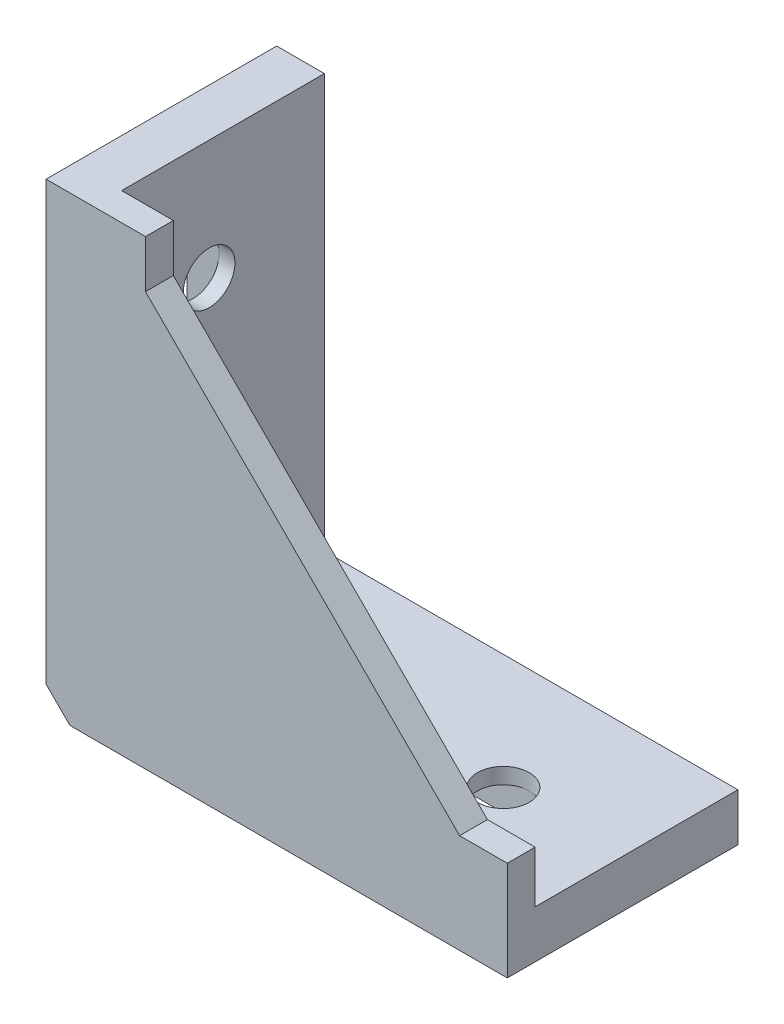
ISO-10303-21;
HEADER;
FILE_DESCRIPTION(('STEP AP214'),'2;1');
FILE_NAME('part.step','',(''),(''),'','','');
FILE_SCHEMA(('AUTOMOTIVE_DESIGN { 1 0 10303 214 1 1 1 1 }'));
ENDSEC;
DATA;
#1=APPLICATION_CONTEXT('core data for automotive mechanical design processes');
#2=APPLICATION_PROTOCOL_DEFINITION('international standard','automotive_design',2000,#1);
#3=PRODUCT_CONTEXT('',#1,'mechanical');
#4=PRODUCT('Part','Part','',(#3));
#5=PRODUCT_RELATED_PRODUCT_CATEGORY('part','',(#4));
#6=PRODUCT_DEFINITION_FORMATION('','',#4);
#7=PRODUCT_DEFINITION_CONTEXT('part definition',#1,'design');
#8=PRODUCT_DEFINITION('design','',#6,#7);
#9=PRODUCT_DEFINITION_SHAPE('','',#8);
#10=(LENGTH_UNIT() NAMED_UNIT(*) SI_UNIT(.MILLI.,.METRE.));
#11=(NAMED_UNIT(*) PLANE_ANGLE_UNIT() SI_UNIT($,.RADIAN.));
#12=(NAMED_UNIT(*) SI_UNIT($,.STERADIAN.) SOLID_ANGLE_UNIT());
#13=UNCERTAINTY_MEASURE_WITH_UNIT(LENGTH_MEASURE(1.E-05),#10,'distance_accuracy_value','');
#14=(GEOMETRIC_REPRESENTATION_CONTEXT(3) GLOBAL_UNCERTAINTY_ASSIGNED_CONTEXT((#13)) GLOBAL_UNIT_ASSIGNED_CONTEXT((#10,
#11,#12)) REPRESENTATION_CONTEXT('',''));
#15=CARTESIAN_POINT('',(0.,0.,0.));
#16=DIRECTION('',(0.,0.,1.));
#17=DIRECTION('',(1.,0.,0.));
#18=AXIS2_PLACEMENT_3D('',#15,#16,#17);
#19=CARTESIAN_POINT('',(-42.3884242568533,-0.51625172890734,29.));
#20=DIRECTION('',(1.,0.,0.));
#21=DIRECTION('',(0.,0.,-1.));
#22=AXIS2_PLACEMENT_3D('',#19,#20,#21);
#23=PLANE('',#22);
#24=DIRECTION('',(0.,1.,0.));
#25=VECTOR('',#24,1.);
#26=CARTESIAN_POINT('',(-42.3884242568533,0.,21.5));
#27=LINE('',#26,#25);
#28=CARTESIAN_POINT('',(-42.3884242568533,5.88069288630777,21.5));
#29=VERTEX_POINT('',#28);
#30=CARTESIAN_POINT('',(-42.3884242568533,53.6601801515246,21.5));
#31=VERTEX_POINT('',#30);
#32=EDGE_CURVE('E583',#29,#31,#27,.T.);
#33=ORIENTED_EDGE('',*,*,#32,.T.);
#34=DIRECTION('',(0.,0.,1.));
#35=VECTOR('',#34,1.);
#36=CARTESIAN_POINT('',(-42.3884242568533,53.6601801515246,0.));
#37=LINE('',#36,#35);
#38=CARTESIAN_POINT('',(-42.3884242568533,53.6601801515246,25.5));
#39=VERTEX_POINT('',#38);
#40=EDGE_CURVE('E591',#31,#39,#37,.T.);
#41=ORIENTED_EDGE('',*,*,#40,.T.);
#42=DIRECTION('',(0.,-1.,0.));
#43=VECTOR('',#42,1.);
#44=CARTESIAN_POINT('',(-42.3884242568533,0.,25.5));
#45=LINE('',#44,#43);
#46=CARTESIAN_POINT('',(-42.3884242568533,5.88069288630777,25.5));
#47=VERTEX_POINT('',#46);
#48=EDGE_CURVE('E603',#39,#47,#45,.T.);
#49=ORIENTED_EDGE('',*,*,#48,.T.);
#50=DIRECTION('',(0.,0.,-1.));
#51=VECTOR('',#50,1.);
#52=CARTESIAN_POINT('',(-42.3884242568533,5.88069288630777,0.));
#53=LINE('',#52,#51);
#54=EDGE_CURVE('E600',#47,#29,#53,.T.);
#55=ORIENTED_EDGE('',*,*,#54,.T.);
#56=EDGE_LOOP('',(#33,#41,#49,#55));
#57=FACE_BOUND('',#56,.T.);
#58=DIRECTION('',(0.,-1.,0.));
#59=VECTOR('',#58,1.);
#60=CARTESIAN_POINT('',(-42.3884242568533,-0.51625172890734,0.));
#61=LINE('',#60,#59);
#62=CARTESIAN_POINT('',(-42.3884242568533,57.4837482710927,0.));
#63=VERTEX_POINT('',#62);
#64=CARTESIAN_POINT('',(-42.3884242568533,2.48374827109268,0.));
#65=VERTEX_POINT('',#64);
#66=EDGE_CURVE('E742',#63,#65,#61,.T.);
#67=ORIENTED_EDGE('',*,*,#66,.T.);
#68=DIRECTION('',(0.,0.,1.));
#69=VECTOR('',#68,1.);
#70=CARTESIAN_POINT('',(-42.3884242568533,2.48374827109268,29.));
#71=LINE('',#70,#69);
#72=CARTESIAN_POINT('',(-42.3884242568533,2.48374827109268,29.));
#73=VERTEX_POINT('',#72);
#74=EDGE_CURVE('E91',#65,#73,#71,.T.);
#75=ORIENTED_EDGE('',*,*,#74,.T.);
#76=DIRECTION('',(0.,-1.,0.));
#77=VECTOR('',#76,1.);
#78=CARTESIAN_POINT('',(-42.3884242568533,-0.51625172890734,29.));
#79=LINE('',#78,#77);
#80=CARTESIAN_POINT('',(-42.3884242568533,57.4837482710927,29.));
#81=VERTEX_POINT('',#80);
#82=EDGE_CURVE('E749',#81,#73,#79,.T.);
#83=ORIENTED_EDGE('',*,*,#82,.F.);
#84=DIRECTION('',(0.,0.,-1.));
#85=VECTOR('',#84,1.);
#86=CARTESIAN_POINT('',(-42.3884242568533,57.4837482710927,29.));
#87=LINE('',#86,#85);
#88=EDGE_CURVE('E758',#81,#63,#87,.T.);
#89=ORIENTED_EDGE('',*,*,#88,.T.);
#90=EDGE_LOOP('',(#67,#75,#83,#89));
#91=FACE_BOUND('',#90,.T.);
#92=DIRECTION('',(0.,1.,0.));
#93=VECTOR('',#92,1.);
#94=CARTESIAN_POINT('',(-42.3884242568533,0.,3.5));
#95=LINE('',#94,#93);
#96=CARTESIAN_POINT('',(-42.3884242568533,6.48374827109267,3.5));
#97=VERTEX_POINT('',#96);
#98=CARTESIAN_POINT('',(-42.3884242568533,53.6601801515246,3.5));
#99=VERTEX_POINT('',#98);
#100=EDGE_CURVE('E646',#97,#99,#95,.T.);
#101=ORIENTED_EDGE('',*,*,#100,.T.);
#102=DIRECTION('',(0.,0.,1.));
#103=VECTOR('',#102,1.);
#104=CARTESIAN_POINT('',(-42.3884242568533,53.6601801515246,0.));
#105=LINE('',#104,#103);
#106=CARTESIAN_POINT('',(-42.3884242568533,53.6601801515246,7.5));
#107=VERTEX_POINT('',#106);
#108=EDGE_CURVE('E651',#99,#107,#105,.T.);
#109=ORIENTED_EDGE('',*,*,#108,.T.);
#110=DIRECTION('',(0.,-1.,0.));
#111=VECTOR('',#110,1.);
#112=CARTESIAN_POINT('',(-42.3884242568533,0.,7.5));
#113=LINE('',#112,#111);
#114=CARTESIAN_POINT('',(-42.3884242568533,6.48374827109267,7.5));
#115=VERTEX_POINT('',#114);
#116=EDGE_CURVE('E663',#107,#115,#113,.T.);
#117=ORIENTED_EDGE('',*,*,#116,.T.);
#118=DIRECTION('',(0.,0.,-1.));
#119=VECTOR('',#118,1.);
#120=CARTESIAN_POINT('',(-42.3884242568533,6.48374827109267,0.));
#121=LINE('',#120,#119);
#122=EDGE_CURVE('E660',#115,#97,#121,.T.);
#123=ORIENTED_EDGE('',*,*,#122,.T.);
#124=EDGE_LOOP('',(#101,#109,#117,#123));
#125=FACE_BOUND('',#124,.T.);
#126=DIRECTION('',(0.,1.,0.));
#127=VECTOR('',#126,1.);
#128=CARTESIAN_POINT('',(-42.3884242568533,50.4837482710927,17.));
#129=LINE('',#128,#127);
#130=CARTESIAN_POINT('',(-42.3884242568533,50.4837482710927,17.));
#131=VERTEX_POINT('',#130);
#132=CARTESIAN_POINT('',(-42.3884242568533,52.4837482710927,17.));
#133=VERTEX_POINT('',#132);
#134=EDGE_CURVE('E537',#131,#133,#129,.T.);
#135=ORIENTED_EDGE('',*,*,#134,.F.);
#136=DIRECTION('',(0.,0.,1.));
#137=VECTOR('',#136,1.);
#138=CARTESIAN_POINT('',(-42.3884242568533,50.4837482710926,0.));
#139=LINE('',#138,#137);
#140=CARTESIAN_POINT('',(-42.3884242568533,50.4837482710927,17.75));
#141=VERTEX_POINT('',#140);
#142=EDGE_CURVE('E627',#131,#141,#139,.T.);
#143=ORIENTED_EDGE('',*,*,#142,.T.);
#144=DIRECTION('',(0.,-1.,0.));
#145=VECTOR('',#144,1.);
#146=CARTESIAN_POINT('',(-42.3884242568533,0.,17.75));
#147=LINE('',#146,#145);
#148=CARTESIAN_POINT('',(-42.3884242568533,6.48374827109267,17.75));
#149=VERTEX_POINT('',#148);
#150=EDGE_CURVE('E680',#141,#149,#147,.T.);
#151=ORIENTED_EDGE('',*,*,#150,.T.);
#152=DIRECTION('',(0.,0.,-1.));
#153=VECTOR('',#152,1.);
#154=CARTESIAN_POINT('',(-42.3884242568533,6.48374827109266,0.));
#155=LINE('',#154,#153);
#156=CARTESIAN_POINT('',(-42.3884242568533,6.48374827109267,17.));
#157=VERTEX_POINT('',#156);
#158=EDGE_CURVE('E568',#149,#157,#155,.T.);
#159=ORIENTED_EDGE('',*,*,#158,.T.);
#160=DIRECTION('',(0.,1.,0.));
#161=VECTOR('',#160,1.);
#162=CARTESIAN_POINT('',(-42.3884242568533,4.48374827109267,17.));
#163=LINE('',#162,#161);
#164=CARTESIAN_POINT('',(-42.3884242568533,4.48374827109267,17.));
#165=VERTEX_POINT('',#164);
#166=EDGE_CURVE('E1207',#165,#157,#163,.T.);
#167=ORIENTED_EDGE('',*,*,#166,.F.);
#168=DIRECTION('',(0.,0.,1.));
#169=VECTOR('',#168,1.);
#170=CARTESIAN_POINT('',(-42.3884242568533,4.48374827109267,12.));
#171=LINE('',#170,#169);
#172=CARTESIAN_POINT('',(-42.3884242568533,4.48374827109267,12.));
#173=VERTEX_POINT('',#172);
#174=EDGE_CURVE('E1198',#173,#165,#171,.T.);
#175=ORIENTED_EDGE('',*,*,#174,.F.);
#176=DIRECTION('',(0.,-1.,0.));
#177=VECTOR('',#176,1.);
#178=CARTESIAN_POINT('',(-42.3884242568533,6.48374827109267,12.));
#179=LINE('',#178,#177);
#180=CARTESIAN_POINT('',(-42.3884242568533,6.48374827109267,12.));
#181=VERTEX_POINT('',#180);
#182=EDGE_CURVE('E1194',#181,#173,#179,.T.);
#183=ORIENTED_EDGE('',*,*,#182,.F.);
#184=CARTESIAN_POINT('',(-42.3884242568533,6.48374827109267,11.25));
#185=VERTEX_POINT('',#184);
#186=EDGE_CURVE('E572',#181,#185,#155,.T.);
#187=ORIENTED_EDGE('',*,*,#186,.T.);
#188=DIRECTION('',(0.,-1.,0.));
#189=VECTOR('',#188,1.);
#190=CARTESIAN_POINT('',(-42.3884242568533,0.,11.25));
#191=LINE('',#190,#189);
#192=CARTESIAN_POINT('',(-42.3884242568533,50.4837482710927,11.25));
#193=VERTEX_POINT('',#192);
#194=EDGE_CURVE('E671',#193,#185,#191,.T.);
#195=ORIENTED_EDGE('',*,*,#194,.F.);
#196=CARTESIAN_POINT('',(-42.3884242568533,50.4837482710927,12.));
#197=VERTEX_POINT('',#196);
#198=EDGE_CURVE('E625',#193,#197,#139,.T.);
#199=ORIENTED_EDGE('',*,*,#198,.T.);
#200=DIRECTION('',(0.,-1.,0.));
#201=VECTOR('',#200,1.);
#202=CARTESIAN_POINT('',(-42.3884242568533,52.4837482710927,12.));
#203=LINE('',#202,#201);
#204=CARTESIAN_POINT('',(-42.3884242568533,52.4837482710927,12.));
#205=VERTEX_POINT('',#204);
#206=EDGE_CURVE('E1320',#205,#197,#203,.T.);
#207=ORIENTED_EDGE('',*,*,#206,.F.);
#208=DIRECTION('',(0.,0.,-1.));
#209=VECTOR('',#208,1.);
#210=CARTESIAN_POINT('',(-42.3884242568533,52.4837482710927,17.));
#211=LINE('',#210,#209);
#212=EDGE_CURVE('E1188',#133,#205,#211,.T.);
#213=ORIENTED_EDGE('',*,*,#212,.F.);
#214=EDGE_LOOP('',(#135,#143,#151,#159,#167,#175,#183,#187,#195,#199,#207,#213));
#215=FACE_BOUND('',#214,.T.);
#216=ADVANCED_FACE('F83',(#57,#91,#125,#215),#23,.F.);
#217=CARTESIAN_POINT('',(-27.3884242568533,57.4837482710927,14.5));
#218=DIRECTION('',(0.,-1.,0.));
#219=DIRECTION('',(1.,0.,0.));
#220=AXIS2_PLACEMENT_3D('',#217,#218,#219);
#221=CYLINDRICAL_SURFACE('',#220,3.25);
#222=DIRECTION('',(0.,-1.,0.));
#223=VECTOR('',#222,1.);
#224=CARTESIAN_POINT('',(-27.3884242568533,57.4837482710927,17.75));
#225=LINE('',#224,#223);
#226=CARTESIAN_POINT('',(-27.3884242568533,5.48374827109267,17.75));
#227=VERTEX_POINT('',#226);
#228=CARTESIAN_POINT('',(-27.3884242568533,3.48374827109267,17.75));
#229=VERTEX_POINT('',#228);
#230=EDGE_CURVE('E1137',#227,#229,#225,.T.);
#231=ORIENTED_EDGE('',*,*,#230,.T.);
#232=CARTESIAN_POINT('',(-27.3884242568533,3.48374827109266,14.5));
#233=DIRECTION('',(0.,1.,0.));
#234=DIRECTION('',(0.,0.,1.));
#235=AXIS2_PLACEMENT_3D('',#232,#233,#234);
#236=CIRCLE('',#235,3.25);
#237=CARTESIAN_POINT('',(-27.3884242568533,3.48374827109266,11.25));
#238=VERTEX_POINT('',#237);
#239=EDGE_CURVE('E1293',#229,#238,#236,.F.);
#240=ORIENTED_EDGE('',*,*,#239,.T.);
#241=DIRECTION('',(0.,-1.,0.));
#242=VECTOR('',#241,1.);
#243=CARTESIAN_POINT('',(-27.3884242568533,57.4837482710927,11.25));
#244=LINE('',#243,#242);
#245=CARTESIAN_POINT('',(-27.3884242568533,5.48374827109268,11.25));
#246=VERTEX_POINT('',#245);
#247=EDGE_CURVE('E1134',#246,#238,#244,.T.);
#248=ORIENTED_EDGE('',*,*,#247,.F.);
#249=CARTESIAN_POINT('',(-27.3884242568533,5.48374827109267,14.5));
#250=DIRECTION('',(0.,-1.,0.));
#251=DIRECTION('',(0.,0.,-1.));
#252=AXIS2_PLACEMENT_3D('',#249,#250,#251);
#253=CIRCLE('',#252,3.25);
#254=EDGE_CURVE('E1144',#246,#227,#253,.F.);
#255=ORIENTED_EDGE('',*,*,#254,.T.);
#256=EDGE_LOOP('',(#231,#240,#248,#255));
#257=FACE_BOUND('',#256,.T.);
#258=ADVANCED_FACE('F801',(#257),#221,.F.);
#259=CARTESIAN_POINT('',(0.611575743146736,57.4837482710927,14.5));
#260=DIRECTION('',(0.,-1.,0.));
#261=DIRECTION('',(1.,0.,0.));
#262=AXIS2_PLACEMENT_3D('',#259,#260,#261);
#263=CYLINDRICAL_SURFACE('',#262,3.25);
#264=CARTESIAN_POINT('',(0.611575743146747,5.48374827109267,14.5));
#265=DIRECTION('',(0.,-1.,0.));
#266=DIRECTION('',(0.,0.,-1.));
#267=AXIS2_PLACEMENT_3D('',#264,#265,#266);
#268=CIRCLE('',#267,3.25);
#269=CARTESIAN_POINT('',(0.611575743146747,5.48374827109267,11.25));
#270=VERTEX_POINT('',#269);
#271=EDGE_CURVE('E1151',#270,#270,#268,.F.);
#272=ORIENTED_EDGE('',*,*,#271,.T.);
#273=EDGE_LOOP('',(#272));
#274=FACE_BOUND('',#273,.T.);
#275=CARTESIAN_POINT('',(0.611575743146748,3.48374827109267,14.5));
#276=DIRECTION('',(0.,1.,0.));
#277=DIRECTION('',(0.,0.,1.));
#278=AXIS2_PLACEMENT_3D('',#275,#276,#277);
#279=CIRCLE('',#278,3.25);
#280=CARTESIAN_POINT('',(0.611575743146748,3.48374827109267,17.75));
#281=VERTEX_POINT('',#280);
#282=CARTESIAN_POINT('',(0.611575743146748,3.48374827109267,11.25));
#283=VERTEX_POINT('',#282);
#284=EDGE_CURVE('E1085',#281,#283,#279,.F.);
#285=ORIENTED_EDGE('',*,*,#284,.T.);
#286=CARTESIAN_POINT('',(0.611575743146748,3.48374827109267,14.5));
#287=DIRECTION('',(0.,1.,0.));
#288=DIRECTION('',(0.,0.,1.));
#289=AXIS2_PLACEMENT_3D('',#286,#287,#288);
#290=CIRCLE('',#289,3.25);
#291=EDGE_CURVE('E1064',#283,#281,#290,.F.);
#292=ORIENTED_EDGE('',*,*,#291,.T.);
#293=EDGE_LOOP('',(#285,#292));
#294=FACE_BOUND('',#293,.T.);
#295=ADVANCED_FACE('F806',(#274,#294),#263,.F.);
#296=CARTESIAN_POINT('',(-15.3884242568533,57.4837482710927,14.5));
#297=DIRECTION('',(0.,-1.,0.));
#298=DIRECTION('',(1.,0.,0.));
#299=AXIS2_PLACEMENT_3D('',#296,#297,#298);
#300=CYLINDRICAL_SURFACE('',#299,3.25);
#301=DIRECTION('',(0.,-1.,0.));
#302=VECTOR('',#301,1.);
#303=CARTESIAN_POINT('',(-15.3884242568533,57.4837482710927,11.25));
#304=LINE('',#303,#302);
#305=CARTESIAN_POINT('',(-15.3884242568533,5.48374827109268,11.25));
#306=VERTEX_POINT('',#305);
#307=CARTESIAN_POINT('',(-15.3884242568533,3.48374827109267,11.25));
#308=VERTEX_POINT('',#307);
#309=EDGE_CURVE('E1130',#306,#308,#304,.T.);
#310=ORIENTED_EDGE('',*,*,#309,.T.);
#311=CARTESIAN_POINT('',(-15.3884242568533,3.48374827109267,14.5));
#312=DIRECTION('',(0.,1.,0.));
#313=DIRECTION('',(0.,0.,1.));
#314=AXIS2_PLACEMENT_3D('',#311,#312,#313);
#315=CIRCLE('',#314,3.25);
#316=CARTESIAN_POINT('',(-15.3884242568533,3.48374827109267,17.75));
#317=VERTEX_POINT('',#316);
#318=EDGE_CURVE('E1090',#308,#317,#315,.F.);
#319=ORIENTED_EDGE('',*,*,#318,.T.);
#320=DIRECTION('',(0.,-1.,0.));
#321=VECTOR('',#320,1.);
#322=CARTESIAN_POINT('',(-15.3884242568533,57.4837482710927,17.75));
#323=LINE('',#322,#321);
#324=CARTESIAN_POINT('',(-15.3884242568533,5.48374827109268,17.75));
#325=VERTEX_POINT('',#324);
#326=EDGE_CURVE('E1129',#325,#317,#323,.T.);
#327=ORIENTED_EDGE('',*,*,#326,.F.);
#328=CARTESIAN_POINT('',(-15.3884242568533,5.48374827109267,14.5));
#329=DIRECTION('',(0.,-1.,0.));
#330=DIRECTION('',(0.,0.,-1.));
#331=AXIS2_PLACEMENT_3D('',#328,#329,#330);
#332=CIRCLE('',#331,3.25);
#333=EDGE_CURVE('E1149',#325,#306,#332,.F.);
#334=ORIENTED_EDGE('',*,*,#333,.T.);
#335=EDGE_LOOP('',(#310,#319,#327,#334));
#336=FACE_BOUND('',#335,.T.);
#337=ADVANCED_FACE('F820',(#336),#300,.F.);
#338=CARTESIAN_POINT('',(-36.3884242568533,5.48374827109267,29.));
#339=DIRECTION('',(0.,-1.,0.));
#340=DIRECTION('',(0.,0.,-1.));
#341=AXIS2_PLACEMENT_3D('',#338,#339,#340);
#342=PLANE('',#341);
#343=ORIENTED_EDGE('',*,*,#271,.F.);
#344=EDGE_LOOP('',(#343));
#345=FACE_BOUND('',#344,.T.);
#346=DIRECTION('',(1.,0.,0.));
#347=VECTOR('',#346,1.);
#348=CARTESIAN_POINT('',(-36.3884242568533,5.48374827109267,25.5));
#349=LINE('',#348,#347);
#350=CARTESIAN_POINT('',(-36.3884242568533,5.48374827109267,25.5));
#351=VERTEX_POINT('',#350);
#352=CARTESIAN_POINT('',(15.6115757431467,5.48374827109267,25.5));
#353=VERTEX_POINT('',#352);
#354=EDGE_CURVE('E712',#351,#353,#349,.T.);
#355=ORIENTED_EDGE('',*,*,#354,.T.);
#356=DIRECTION('',(0.,0.,-1.));
#357=VECTOR('',#356,1.);
#358=CARTESIAN_POINT('',(15.6115757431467,5.48374827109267,29.));
#359=LINE('',#358,#357);
#360=CARTESIAN_POINT('',(15.6115757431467,5.48374827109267,0.));
#361=VERTEX_POINT('',#360);
#362=EDGE_CURVE('E557',#353,#361,#359,.T.);
#363=ORIENTED_EDGE('',*,*,#362,.T.);
#364=DIRECTION('',(-1.,0.,0.));
#365=VECTOR('',#364,1.);
#366=CARTESIAN_POINT('',(-36.3884242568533,5.48374827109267,0.));
#367=LINE('',#366,#365);
#368=CARTESIAN_POINT('',(-36.3884242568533,5.48374827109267,0.));
#369=VERTEX_POINT('',#368);
#370=EDGE_CURVE('E764',#361,#369,#367,.T.);
#371=ORIENTED_EDGE('',*,*,#370,.T.);
#372=DIRECTION('',(0.,0.,-1.));
#373=VECTOR('',#372,1.);
#374=CARTESIAN_POINT('',(-36.3884242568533,5.48374827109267,29.));
#375=LINE('',#374,#373);
#376=EDGE_CURVE('E564',#351,#369,#375,.T.);
#377=ORIENTED_EDGE('',*,*,#376,.F.);
#378=EDGE_LOOP('',(#355,#363,#371,#377));
#379=FACE_BOUND('',#378,.T.);
#380=ORIENTED_EDGE('',*,*,#333,.F.);
#381=DIRECTION('',(-1.,0.,0.));
#382=VECTOR('',#381,1.);
#383=CARTESIAN_POINT('',(-36.3884242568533,5.48374827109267,17.75));
#384=LINE('',#383,#382);
#385=EDGE_CURVE('E1133',#325,#227,#384,.T.);
#386=ORIENTED_EDGE('',*,*,#385,.T.);
#387=ORIENTED_EDGE('',*,*,#254,.F.);
#388=DIRECTION('',(-1.,0.,0.));
#389=VECTOR('',#388,1.);
#390=CARTESIAN_POINT('',(-36.3884242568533,5.48374827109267,11.25));
#391=LINE('',#390,#389);
#392=EDGE_CURVE('E1147',#306,#246,#391,.T.);
#393=ORIENTED_EDGE('',*,*,#392,.F.);
#394=EDGE_LOOP('',(#380,#386,#387,#393));
#395=FACE_BOUND('',#394,.T.);
#396=ADVANCED_FACE('F782',(#345,#379,#395),#342,.F.);
#397=CARTESIAN_POINT('',(15.6115757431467,-0.51625172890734,29.));
#398=DIRECTION('',(0.,1.,0.));
#399=DIRECTION('',(0.,0.,1.));
#400=AXIS2_PLACEMENT_3D('',#397,#398,#399);
#401=PLANE('',#400);
#402=DIRECTION('',(0.,0.,1.));
#403=VECTOR('',#402,1.);
#404=CARTESIAN_POINT('',(11.7880076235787,-0.516251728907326,0.));
#405=LINE('',#404,#403);
#406=CARTESIAN_POINT('',(11.7880076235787,-0.51625172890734,21.5));
#407=VERTEX_POINT('',#406);
#408=CARTESIAN_POINT('',(11.7880076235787,-0.516251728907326,25.5));
#409=VERTEX_POINT('',#408);
#410=EDGE_CURVE('E1260',#407,#409,#405,.T.);
#411=ORIENTED_EDGE('',*,*,#410,.F.);
#412=DIRECTION('',(1.,0.,0.));
#413=VECTOR('',#412,1.);
#414=CARTESIAN_POINT('',(-41.8721725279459,-0.51625172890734,21.5));
#415=LINE('',#414,#413);
#416=CARTESIAN_POINT('',(-35.9914796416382,-0.51625172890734,21.5));
#417=VERTEX_POINT('',#416);
#418=EDGE_CURVE('E1241',#417,#407,#415,.T.);
#419=ORIENTED_EDGE('',*,*,#418,.F.);
#420=DIRECTION('',(0.,0.,-1.));
#421=VECTOR('',#420,1.);
#422=CARTESIAN_POINT('',(-35.9914796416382,-0.51625172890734,0.));
#423=LINE('',#422,#421);
#424=CARTESIAN_POINT('',(-35.9914796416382,-0.51625172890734,25.5));
#425=VERTEX_POINT('',#424);
#426=EDGE_CURVE('E1249',#425,#417,#423,.T.);
#427=ORIENTED_EDGE('',*,*,#426,.F.);
#428=DIRECTION('',(-1.,0.,0.));
#429=VECTOR('',#428,1.);
#430=CARTESIAN_POINT('',(-41.8721725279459,-0.51625172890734,25.5));
#431=LINE('',#430,#429);
#432=EDGE_CURVE('E1263',#409,#425,#431,.T.);
#433=ORIENTED_EDGE('',*,*,#432,.F.);
#434=EDGE_LOOP('',(#411,#419,#427,#433));
#435=FACE_BOUND('',#434,.T.);
#436=DIRECTION('',(0.,0.,1.));
#437=VECTOR('',#436,1.);
#438=CARTESIAN_POINT('',(11.7880076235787,-0.516251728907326,0.));
#439=LINE('',#438,#437);
#440=CARTESIAN_POINT('',(11.7880076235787,-0.51625172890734,3.5));
#441=VERTEX_POINT('',#440);
#442=CARTESIAN_POINT('',(11.7880076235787,-0.516251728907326,7.5));
#443=VERTEX_POINT('',#442);
#444=EDGE_CURVE('E1109',#441,#443,#439,.T.);
#445=ORIENTED_EDGE('',*,*,#444,.F.);
#446=DIRECTION('',(1.,0.,0.));
#447=VECTOR('',#446,1.);
#448=CARTESIAN_POINT('',(-41.8721725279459,-0.51625172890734,3.5));
#449=LINE('',#448,#447);
#450=CARTESIAN_POINT('',(-35.3884242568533,-0.51625172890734,3.5));
#451=VERTEX_POINT('',#450);
#452=EDGE_CURVE('E1093',#451,#441,#449,.T.);
#453=ORIENTED_EDGE('',*,*,#452,.F.);
#454=DIRECTION('',(0.,0.,-1.));
#455=VECTOR('',#454,1.);
#456=CARTESIAN_POINT('',(-35.3884242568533,-0.51625172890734,0.));
#457=LINE('',#456,#455);
#458=CARTESIAN_POINT('',(-35.3884242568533,-0.51625172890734,7.5));
#459=VERTEX_POINT('',#458);
#460=EDGE_CURVE('E1098',#459,#451,#457,.T.);
#461=ORIENTED_EDGE('',*,*,#460,.F.);
#462=DIRECTION('',(-1.,0.,0.));
#463=VECTOR('',#462,1.);
#464=CARTESIAN_POINT('',(-41.8721725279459,-0.51625172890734,7.5));
#465=LINE('',#464,#463);
#466=EDGE_CURVE('E1112',#443,#459,#465,.T.);
#467=ORIENTED_EDGE('',*,*,#466,.F.);
#468=EDGE_LOOP('',(#445,#453,#461,#467));
#469=FACE_BOUND('',#468,.T.);
#470=DIRECTION('',(1.,0.,0.));
#471=VECTOR('',#470,1.);
#472=CARTESIAN_POINT('',(15.6115757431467,-0.51625172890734,29.));
#473=LINE('',#472,#471);
#474=CARTESIAN_POINT('',(-39.3884242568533,-0.516251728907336,29.));
#475=VERTEX_POINT('',#474);
#476=CARTESIAN_POINT('',(15.6115757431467,-0.51625172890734,29.));
#477=VERTEX_POINT('',#476);
#478=EDGE_CURVE('E751',#475,#477,#473,.T.);
#479=ORIENTED_EDGE('',*,*,#478,.F.);
#480=DIRECTION('',(0.,0.,-1.));
#481=VECTOR('',#480,1.);
#482=CARTESIAN_POINT('',(-39.3884242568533,-0.51625172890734,29.));
#483=LINE('',#482,#481);
#484=CARTESIAN_POINT('',(-39.3884242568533,-0.516251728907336,0.));
#485=VERTEX_POINT('',#484);
#486=EDGE_CURVE('E549',#475,#485,#483,.T.);
#487=ORIENTED_EDGE('',*,*,#486,.T.);
#488=DIRECTION('',(1.,0.,0.));
#489=VECTOR('',#488,1.);
#490=CARTESIAN_POINT('',(15.6115757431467,-0.51625172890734,0.));
#491=LINE('',#490,#489);
#492=CARTESIAN_POINT('',(15.6115757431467,-0.51625172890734,0.));
#493=VERTEX_POINT('',#492);
#494=EDGE_CURVE('E760',#485,#493,#491,.T.);
#495=ORIENTED_EDGE('',*,*,#494,.T.);
#496=DIRECTION('',(0.,0.,-1.));
#497=VECTOR('',#496,1.);
#498=CARTESIAN_POINT('',(15.6115757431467,-0.51625172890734,29.));
#499=LINE('',#498,#497);
#500=EDGE_CURVE('E552',#477,#493,#499,.T.);
#501=ORIENTED_EDGE('',*,*,#500,.F.);
#502=EDGE_LOOP('',(#479,#487,#495,#501));
#503=FACE_BOUND('',#502,.T.);
#504=DIRECTION('',(0.,0.,-1.));
#505=VECTOR('',#504,1.);
#506=CARTESIAN_POINT('',(10.6115757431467,-0.516251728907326,17.));
#507=LINE('',#506,#505);
#508=CARTESIAN_POINT('',(10.6115757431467,-0.516251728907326,17.));
#509=VERTEX_POINT('',#508);
#510=CARTESIAN_POINT('',(10.6115757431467,-0.516251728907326,12.));
#511=VERTEX_POINT('',#510);
#512=EDGE_CURVE('E501',#509,#511,#507,.T.);
#513=ORIENTED_EDGE('',*,*,#512,.T.);
#514=DIRECTION('',(-1.,0.,0.));
#515=VECTOR('',#514,1.);
#516=CARTESIAN_POINT('',(10.6115757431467,-0.516251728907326,12.));
#517=LINE('',#516,#515);
#518=CARTESIAN_POINT('',(8.61157574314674,-0.516251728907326,12.));
#519=VERTEX_POINT('',#518);
#520=EDGE_CURVE('E499',#511,#519,#517,.T.);
#521=ORIENTED_EDGE('',*,*,#520,.T.);
#522=DIRECTION('',(0.,0.,1.));
#523=VECTOR('',#522,1.);
#524=CARTESIAN_POINT('',(8.61157574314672,-0.516251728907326,0.));
#525=LINE('',#524,#523);
#526=CARTESIAN_POINT('',(8.61157574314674,-0.516251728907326,11.25));
#527=VERTEX_POINT('',#526);
#528=EDGE_CURVE('E474',#527,#519,#525,.T.);
#529=ORIENTED_EDGE('',*,*,#528,.F.);
#530=DIRECTION('',(-1.,0.,0.));
#531=VECTOR('',#530,1.);
#532=CARTESIAN_POINT('',(-41.8721725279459,-0.51625172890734,11.25));
#533=LINE('',#532,#531);
#534=CARTESIAN_POINT('',(-35.3884242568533,-0.51625172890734,11.25));
#535=VERTEX_POINT('',#534);
#536=EDGE_CURVE('E1126',#527,#535,#533,.T.);
#537=ORIENTED_EDGE('',*,*,#536,.T.);
#538=DIRECTION('',(0.,0.,-1.));
#539=VECTOR('',#538,1.);
#540=CARTESIAN_POINT('',(-35.3884242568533,-0.51625172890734,0.));
#541=LINE('',#540,#539);
#542=CARTESIAN_POINT('',(-35.3884242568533,-0.51625172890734,12.));
#543=VERTEX_POINT('',#542);
#544=EDGE_CURVE('E532',#543,#535,#541,.T.);
#545=ORIENTED_EDGE('',*,*,#544,.F.);
#546=DIRECTION('',(-1.,0.,0.));
#547=VECTOR('',#546,1.);
#548=CARTESIAN_POINT('',(-35.3884242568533,-0.51625172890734,12.));
#549=LINE('',#548,#547);
#550=CARTESIAN_POINT('',(-37.3884242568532,-0.51625172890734,12.));
#551=VERTEX_POINT('',#550);
#552=EDGE_CURVE('E514',#543,#551,#549,.T.);
#553=ORIENTED_EDGE('',*,*,#552,.T.);
#554=DIRECTION('',(0.,0.,1.));
#555=VECTOR('',#554,1.);
#556=CARTESIAN_POINT('',(-37.3884242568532,-0.51625172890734,12.));
#557=LINE('',#556,#555);
#558=CARTESIAN_POINT('',(-37.3884242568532,-0.51625172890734,17.));
#559=VERTEX_POINT('',#558);
#560=EDGE_CURVE('E526',#551,#559,#557,.T.);
#561=ORIENTED_EDGE('',*,*,#560,.T.);
#562=DIRECTION('',(1.,0.,0.));
#563=VECTOR('',#562,1.);
#564=CARTESIAN_POINT('',(-37.3884242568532,-0.51625172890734,17.));
#565=LINE('',#564,#563);
#566=CARTESIAN_POINT('',(-35.3884242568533,-0.51625172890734,17.));
#567=VERTEX_POINT('',#566);
#568=EDGE_CURVE('E479',#559,#567,#565,.T.);
#569=ORIENTED_EDGE('',*,*,#568,.T.);
#570=CARTESIAN_POINT('',(-35.3884242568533,-0.51625172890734,17.75));
#571=VERTEX_POINT('',#570);
#572=EDGE_CURVE('E1229',#571,#567,#541,.T.);
#573=ORIENTED_EDGE('',*,*,#572,.F.);
#574=DIRECTION('',(-1.,0.,0.));
#575=VECTOR('',#574,1.);
#576=CARTESIAN_POINT('',(-41.8721725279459,-0.51625172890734,17.75));
#577=LINE('',#576,#575);
#578=CARTESIAN_POINT('',(8.61157574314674,-0.516251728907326,17.75));
#579=VERTEX_POINT('',#578);
#580=EDGE_CURVE('E1062',#579,#571,#577,.T.);
#581=ORIENTED_EDGE('',*,*,#580,.F.);
#582=CARTESIAN_POINT('',(8.61157574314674,-0.516251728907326,17.));
#583=VERTEX_POINT('',#582);
#584=EDGE_CURVE('E1059',#583,#579,#525,.T.);
#585=ORIENTED_EDGE('',*,*,#584,.F.);
#586=DIRECTION('',(1.,0.,0.));
#587=VECTOR('',#586,1.);
#588=CARTESIAN_POINT('',(8.61157574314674,-0.516251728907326,17.));
#589=LINE('',#588,#587);
#590=EDGE_CURVE('E490',#583,#509,#589,.T.);
#591=ORIENTED_EDGE('',*,*,#590,.T.);
#592=EDGE_LOOP('',(#513,#521,#529,#537,#545,#553,#561,#569,#573,#581,#585,#591));
#593=FACE_BOUND('',#592,.T.);
#594=ADVANCED_FACE('F810',(#435,#469,#503,#593),#401,.F.);
#595=CARTESIAN_POINT('',(15.6115757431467,14.4837482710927,14.5));
#596=DIRECTION('',(-1.,0.,0.));
#597=DIRECTION('',(0.,0.,1.));
#598=AXIS2_PLACEMENT_3D('',#595,#596,#597);
#599=CYLINDRICAL_SURFACE('',#598,3.25);
#600=CARTESIAN_POINT('',(-38.3884242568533,14.4837482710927,14.5));
#601=DIRECTION('',(-1.,0.,0.));
#602=DIRECTION('',(0.,0.,1.));
#603=AXIS2_PLACEMENT_3D('',#600,#601,#602);
#604=CIRCLE('',#603,3.25);
#605=CARTESIAN_POINT('',(-38.3884242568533,14.4837482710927,17.75));
#606=VERTEX_POINT('',#605);
#607=CARTESIAN_POINT('',(-38.3884242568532,14.4837482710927,11.25));
#608=VERTEX_POINT('',#607);
#609=EDGE_CURVE('E577',#606,#608,#604,.F.);
#610=ORIENTED_EDGE('',*,*,#609,.F.);
#611=DIRECTION('',(-1.,0.,0.));
#612=VECTOR('',#611,1.);
#613=CARTESIAN_POINT('',(15.6115757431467,14.4837482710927,17.75));
#614=LINE('',#613,#612);
#615=CARTESIAN_POINT('',(-36.3884242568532,14.4837482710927,17.75));
#616=VERTEX_POINT('',#615);
#617=EDGE_CURVE('E687',#616,#606,#614,.T.);
#618=ORIENTED_EDGE('',*,*,#617,.F.);
#619=CARTESIAN_POINT('',(-36.3884242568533,14.4837482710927,14.5));
#620=DIRECTION('',(-1.,0.,0.));
#621=DIRECTION('',(0.,-1.,0.));
#622=AXIS2_PLACEMENT_3D('',#619,#620,#621);
#623=CIRCLE('',#622,3.25);
#624=CARTESIAN_POINT('',(-36.3884242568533,14.4837482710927,11.25));
#625=VERTEX_POINT('',#624);
#626=EDGE_CURVE('E697',#625,#616,#623,.T.);
#627=ORIENTED_EDGE('',*,*,#626,.F.);
#628=DIRECTION('',(-1.,0.,0.));
#629=VECTOR('',#628,1.);
#630=CARTESIAN_POINT('',(15.6115757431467,14.4837482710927,11.25));
#631=LINE('',#630,#629);
#632=EDGE_CURVE('E690',#625,#608,#631,.T.);
#633=ORIENTED_EDGE('',*,*,#632,.T.);
#634=EDGE_LOOP('',(#610,#618,#627,#633));
#635=FACE_BOUND('',#634,.T.);
#636=ADVANCED_FACE('F813',(#635),#599,.F.);
#637=CARTESIAN_POINT('',(15.6115757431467,42.4837482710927,14.5));
#638=DIRECTION('',(-1.,0.,0.));
#639=DIRECTION('',(0.,0.,1.));
#640=AXIS2_PLACEMENT_3D('',#637,#638,#639);
#641=CYLINDRICAL_SURFACE('',#640,3.25);
#642=CARTESIAN_POINT('',(-36.3884242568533,42.4837482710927,14.5));
#643=DIRECTION('',(-1.,0.,0.));
#644=DIRECTION('',(0.,-1.,0.));
#645=AXIS2_PLACEMENT_3D('',#642,#643,#644);
#646=CIRCLE('',#645,3.25);
#647=CARTESIAN_POINT('',(-36.3884242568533,39.2337482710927,14.5));
#648=VERTEX_POINT('',#647);
#649=EDGE_CURVE('E705',#648,#648,#646,.T.);
#650=ORIENTED_EDGE('',*,*,#649,.F.);
#651=EDGE_LOOP('',(#650));
#652=FACE_BOUND('',#651,.T.);
#653=CARTESIAN_POINT('',(-38.3884242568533,42.4837482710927,14.5));
#654=DIRECTION('',(-1.,0.,0.));
#655=DIRECTION('',(0.,0.,1.));
#656=AXIS2_PLACEMENT_3D('',#653,#654,#655);
#657=CIRCLE('',#656,3.25);
#658=CARTESIAN_POINT('',(-38.3884242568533,42.4837482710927,11.25));
#659=VERTEX_POINT('',#658);
#660=CARTESIAN_POINT('',(-38.3884242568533,42.4837482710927,17.75));
#661=VERTEX_POINT('',#660);
#662=EDGE_CURVE('E620',#659,#661,#657,.F.);
#663=ORIENTED_EDGE('',*,*,#662,.F.);
#664=CARTESIAN_POINT('',(-38.3884242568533,42.4837482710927,14.5));
#665=DIRECTION('',(-1.,0.,0.));
#666=DIRECTION('',(0.,0.,1.));
#667=AXIS2_PLACEMENT_3D('',#664,#665,#666);
#668=CIRCLE('',#667,3.25);
#669=EDGE_CURVE('E643',#661,#659,#668,.F.);
#670=ORIENTED_EDGE('',*,*,#669,.F.);
#671=EDGE_LOOP('',(#663,#670));
#672=FACE_BOUND('',#671,.T.);
#673=ADVANCED_FACE('F849',(#652,#672),#641,.F.);
#674=CARTESIAN_POINT('',(15.6115757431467,26.4837482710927,14.5));
#675=DIRECTION('',(-1.,0.,0.));
#676=DIRECTION('',(0.,0.,1.));
#677=AXIS2_PLACEMENT_3D('',#674,#675,#676);
#678=CYLINDRICAL_SURFACE('',#677,3.25);
#679=CARTESIAN_POINT('',(-38.3884242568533,26.4837482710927,14.5));
#680=DIRECTION('',(-1.,0.,0.));
#681=DIRECTION('',(0.,0.,1.));
#682=AXIS2_PLACEMENT_3D('',#679,#680,#681);
#683=CIRCLE('',#682,3.25);
#684=CARTESIAN_POINT('',(-38.3884242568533,26.4837482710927,11.25));
#685=VERTEX_POINT('',#684);
#686=CARTESIAN_POINT('',(-38.3884242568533,26.4837482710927,17.75));
#687=VERTEX_POINT('',#686);
#688=EDGE_CURVE('E638',#685,#687,#683,.F.);
#689=ORIENTED_EDGE('',*,*,#688,.F.);
#690=DIRECTION('',(-1.,0.,0.));
#691=VECTOR('',#690,1.);
#692=CARTESIAN_POINT('',(15.6115757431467,26.4837482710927,11.25));
#693=LINE('',#692,#691);
#694=CARTESIAN_POINT('',(-36.3884242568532,26.4837482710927,11.25));
#695=VERTEX_POINT('',#694);
#696=EDGE_CURVE('E682',#695,#685,#693,.T.);
#697=ORIENTED_EDGE('',*,*,#696,.F.);
#698=CARTESIAN_POINT('',(-36.3884242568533,26.4837482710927,14.5));
#699=DIRECTION('',(-1.,0.,0.));
#700=DIRECTION('',(0.,-1.,0.));
#701=AXIS2_PLACEMENT_3D('',#698,#699,#700);
#702=CIRCLE('',#701,3.25);
#703=CARTESIAN_POINT('',(-36.3884242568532,26.4837482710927,17.75));
#704=VERTEX_POINT('',#703);
#705=EDGE_CURVE('E702',#704,#695,#702,.T.);
#706=ORIENTED_EDGE('',*,*,#705,.F.);
#707=DIRECTION('',(-1.,0.,0.));
#708=VECTOR('',#707,1.);
#709=CARTESIAN_POINT('',(15.6115757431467,26.4837482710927,17.75));
#710=LINE('',#709,#708);
#711=EDGE_CURVE('E683',#704,#687,#710,.T.);
#712=ORIENTED_EDGE('',*,*,#711,.T.);
#713=EDGE_LOOP('',(#689,#697,#706,#712));
#714=FACE_BOUND('',#713,.T.);
#715=ADVANCED_FACE('F824',(#714),#678,.F.);
#716=CARTESIAN_POINT('',(-36.3884242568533,57.4837482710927,29.));
#717=DIRECTION('',(-1.,0.,0.));
#718=DIRECTION('',(0.,-1.,0.));
#719=AXIS2_PLACEMENT_3D('',#716,#717,#718);
#720=PLANE('',#719);
#721=DIRECTION('',(0.,-1.,0.));
#722=VECTOR('',#721,1.);
#723=CARTESIAN_POINT('',(-36.3884242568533,57.4837482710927,17.75));
#724=LINE('',#723,#722);
#725=EDGE_CURVE('E700',#704,#616,#724,.T.);
#726=ORIENTED_EDGE('',*,*,#725,.F.);
#727=ORIENTED_EDGE('',*,*,#705,.T.);
#728=DIRECTION('',(0.,-1.,0.));
#729=VECTOR('',#728,1.);
#730=CARTESIAN_POINT('',(-36.3884242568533,57.4837482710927,11.25));
#731=LINE('',#730,#729);
#732=EDGE_CURVE('E686',#695,#625,#731,.T.);
#733=ORIENTED_EDGE('',*,*,#732,.T.);
#734=ORIENTED_EDGE('',*,*,#626,.T.);
#735=EDGE_LOOP('',(#726,#727,#733,#734));
#736=FACE_BOUND('',#735,.T.);
#737=ORIENTED_EDGE('',*,*,#649,.T.);
#738=EDGE_LOOP('',(#737));
#739=FACE_BOUND('',#738,.T.);
#740=DIRECTION('',(0.,-1.,0.));
#741=VECTOR('',#740,1.);
#742=CARTESIAN_POINT('',(-36.3884242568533,57.4837482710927,25.5));
#743=LINE('',#742,#741);
#744=CARTESIAN_POINT('',(-36.3884242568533,57.4837482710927,25.5));
#745=VERTEX_POINT('',#744);
#746=EDGE_CURVE('E709',#745,#351,#743,.T.);
#747=ORIENTED_EDGE('',*,*,#746,.T.);
#748=ORIENTED_EDGE('',*,*,#376,.T.);
#749=DIRECTION('',(0.,1.,0.));
#750=VECTOR('',#749,1.);
#751=CARTESIAN_POINT('',(-36.3884242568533,57.4837482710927,0.));
#752=LINE('',#751,#750);
#753=CARTESIAN_POINT('',(-36.3884242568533,57.4837482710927,0.));
#754=VERTEX_POINT('',#753);
#755=EDGE_CURVE('E767',#369,#754,#752,.T.);
#756=ORIENTED_EDGE('',*,*,#755,.T.);
#757=DIRECTION('',(0.,0.,-1.));
#758=VECTOR('',#757,1.);
#759=CARTESIAN_POINT('',(-36.3884242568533,57.4837482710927,29.));
#760=LINE('',#759,#758);
#761=EDGE_CURVE('E773',#745,#754,#760,.T.);
#762=ORIENTED_EDGE('',*,*,#761,.F.);
#763=EDGE_LOOP('',(#747,#748,#756,#762));
#764=FACE_BOUND('',#763,.T.);
#765=ADVANCED_FACE('F776',(#736,#739,#764),#720,.F.);
#766=CARTESIAN_POINT('',(15.6115757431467,5.48374827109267,29.));
#767=DIRECTION('',(-1.,0.,0.));
#768=DIRECTION('',(0.,0.,1.));
#769=AXIS2_PLACEMENT_3D('',#766,#767,#768);
#770=PLANE('',#769);
#771=DIRECTION('',(0.,1.,0.));
#772=VECTOR('',#771,1.);
#773=CARTESIAN_POINT('',(15.6115757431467,5.48374827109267,0.));
#774=LINE('',#773,#772);
#775=EDGE_CURVE('E762',#493,#361,#774,.T.);
#776=ORIENTED_EDGE('',*,*,#775,.T.);
#777=ORIENTED_EDGE('',*,*,#362,.F.);
#778=DIRECTION('',(0.,1.,0.));
#779=VECTOR('',#778,1.);
#780=CARTESIAN_POINT('',(15.6115757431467,5.48374827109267,25.5));
#781=LINE('',#780,#779);
#782=CARTESIAN_POINT('',(15.6115757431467,11.9837482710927,25.5));
#783=VERTEX_POINT('',#782);
#784=EDGE_CURVE('E716',#353,#783,#781,.T.);
#785=ORIENTED_EDGE('',*,*,#784,.T.);
#786=DIRECTION('',(0.,0.,1.));
#787=VECTOR('',#786,1.);
#788=CARTESIAN_POINT('',(15.6115757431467,11.9837482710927,25.5));
#789=LINE('',#788,#787);
#790=CARTESIAN_POINT('',(15.6115757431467,11.9837482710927,29.));
#791=VERTEX_POINT('',#790);
#792=EDGE_CURVE('E731',#783,#791,#789,.T.);
#793=ORIENTED_EDGE('',*,*,#792,.T.);
#794=DIRECTION('',(0.,1.,0.));
#795=VECTOR('',#794,1.);
#796=CARTESIAN_POINT('',(15.6115757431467,5.48374827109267,29.));
#797=LINE('',#796,#795);
#798=EDGE_CURVE('E754',#477,#791,#797,.T.);
#799=ORIENTED_EDGE('',*,*,#798,.F.);
#800=ORIENTED_EDGE('',*,*,#500,.T.);
#801=EDGE_LOOP('',(#776,#777,#785,#793,#799,#800));
#802=FACE_BOUND('',#801,.T.);
#803=ADVANCED_FACE('F815',(#802),#770,.F.);
#804=CARTESIAN_POINT('',(-42.3884242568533,57.4837482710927,29.));
#805=DIRECTION('',(0.,-1.,0.));
#806=DIRECTION('',(0.,0.,-1.));
#807=AXIS2_PLACEMENT_3D('',#804,#805,#806);
#808=PLANE('',#807);
#809=DIRECTION('',(-1.,0.,0.));
#810=VECTOR('',#809,1.);
#811=CARTESIAN_POINT('',(-42.3884242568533,57.4837482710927,0.));
#812=LINE('',#811,#810);
#813=EDGE_CURVE('E752',#754,#63,#812,.T.);
#814=ORIENTED_EDGE('',*,*,#813,.T.);
#815=ORIENTED_EDGE('',*,*,#88,.F.);
#816=DIRECTION('',(-1.,0.,0.));
#817=VECTOR('',#816,1.);
#818=CARTESIAN_POINT('',(-42.3884242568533,57.4837482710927,29.));
#819=LINE('',#818,#817);
#820=CARTESIAN_POINT('',(-29.8884242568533,57.4837482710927,29.));
#821=VERTEX_POINT('',#820);
#822=EDGE_CURVE('E756',#821,#81,#819,.T.);
#823=ORIENTED_EDGE('',*,*,#822,.F.);
#824=DIRECTION('',(0.,0.,1.));
#825=VECTOR('',#824,1.);
#826=CARTESIAN_POINT('',(-29.8884242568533,57.4837482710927,25.5));
#827=LINE('',#826,#825);
#828=CARTESIAN_POINT('',(-29.8884242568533,57.4837482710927,25.5));
#829=VERTEX_POINT('',#828);
#830=EDGE_CURVE('E739',#829,#821,#827,.T.);
#831=ORIENTED_EDGE('',*,*,#830,.F.);
#832=DIRECTION('',(-1.,0.,0.));
#833=VECTOR('',#832,1.);
#834=CARTESIAN_POINT('',(-36.3884242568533,57.4837482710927,25.5));
#835=LINE('',#834,#833);
#836=EDGE_CURVE('E728',#829,#745,#835,.T.);
#837=ORIENTED_EDGE('',*,*,#836,.T.);
#838=ORIENTED_EDGE('',*,*,#761,.T.);
#839=EDGE_LOOP('',(#814,#815,#823,#831,#837,#838));
#840=FACE_BOUND('',#839,.T.);
#841=ADVANCED_FACE('F788',(#840),#808,.F.);
#842=CARTESIAN_POINT('',(-42.3884242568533,57.4837482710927,29.));
#843=DIRECTION('',(0.,0.,-1.));
#844=DIRECTION('',(-1.,0.,0.));
#845=AXIS2_PLACEMENT_3D('',#842,#843,#844);
#846=PLANE('',#845);
#847=ORIENTED_EDGE('',*,*,#82,.T.);
#848=DIRECTION('',(-0.707106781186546,0.707106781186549,0.));
#849=VECTOR('',#848,1.);
#850=CARTESIAN_POINT('',(-39.3884242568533,-0.51625172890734,29.));
#851=LINE('',#850,#849);
#852=EDGE_CURVE('E12',#73,#475,#851,.F.);
#853=ORIENTED_EDGE('',*,*,#852,.T.);
#854=ORIENTED_EDGE('',*,*,#478,.T.);
#855=ORIENTED_EDGE('',*,*,#798,.T.);
#856=DIRECTION('',(-1.,0.,0.));
#857=VECTOR('',#856,1.);
#858=CARTESIAN_POINT('',(15.6115757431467,11.9837482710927,29.));
#859=LINE('',#858,#857);
#860=CARTESIAN_POINT('',(9.61157574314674,11.9837482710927,29.));
#861=VERTEX_POINT('',#860);
#862=EDGE_CURVE('E708',#791,#861,#859,.T.);
#863=ORIENTED_EDGE('',*,*,#862,.T.);
#864=DIRECTION('',(-0.707106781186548,0.707106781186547,0.));
#865=VECTOR('',#864,1.);
#866=CARTESIAN_POINT('',(-29.8884242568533,51.4837482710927,29.));
#867=LINE('',#866,#865);
#868=CARTESIAN_POINT('',(-29.8884242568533,51.4837482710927,29.));
#869=VERTEX_POINT('',#868);
#870=EDGE_CURVE('E734',#861,#869,#867,.T.);
#871=ORIENTED_EDGE('',*,*,#870,.T.);
#872=DIRECTION('',(0.,1.,0.));
#873=VECTOR('',#872,1.);
#874=CARTESIAN_POINT('',(-29.8884242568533,57.4837482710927,29.));
#875=LINE('',#874,#873);
#876=EDGE_CURVE('E713',#869,#821,#875,.T.);
#877=ORIENTED_EDGE('',*,*,#876,.T.);
#878=ORIENTED_EDGE('',*,*,#822,.T.);
#879=EDGE_LOOP('',(#847,#853,#854,#855,#863,#871,#877,#878));
#880=FACE_BOUND('',#879,.T.);
#881=ADVANCED_FACE('F792',(#880),#846,.F.);
#882=CARTESIAN_POINT('',(-42.3884242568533,57.4837482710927,0.));
#883=DIRECTION('',(0.,0.,-1.));
#884=DIRECTION('',(-1.,0.,0.));
#885=AXIS2_PLACEMENT_3D('',#882,#883,#884);
#886=PLANE('',#885);
#887=ORIENTED_EDGE('',*,*,#494,.F.);
#888=DIRECTION('',(0.707106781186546,-0.707106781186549,0.));
#889=VECTOR('',#888,1.);
#890=CARTESIAN_POINT('',(-69.8884242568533,29.9837482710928,0.));
#891=LINE('',#890,#889);
#892=EDGE_CURVE('E105',#485,#65,#891,.F.);
#893=ORIENTED_EDGE('',*,*,#892,.T.);
#894=ORIENTED_EDGE('',*,*,#66,.F.);
#895=ORIENTED_EDGE('',*,*,#813,.F.);
#896=ORIENTED_EDGE('',*,*,#755,.F.);
#897=ORIENTED_EDGE('',*,*,#370,.F.);
#898=ORIENTED_EDGE('',*,*,#775,.F.);
#899=EDGE_LOOP('',(#887,#893,#894,#895,#896,#897,#898));
#900=FACE_BOUND('',#899,.T.);
#901=ADVANCED_FACE('F785',(#900),#886,.T.);
#902=CARTESIAN_POINT('',(-29.8884242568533,57.4837482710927,25.5));
#903=DIRECTION('',(1.,0.,0.));
#904=DIRECTION('',(0.,0.,-1.));
#905=AXIS2_PLACEMENT_3D('',#902,#903,#904);
#906=PLANE('',#905);
#907=ORIENTED_EDGE('',*,*,#876,.F.);
#908=DIRECTION('',(0.,0.,1.));
#909=VECTOR('',#908,1.);
#910=CARTESIAN_POINT('',(-29.8884242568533,51.4837482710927,25.5));
#911=LINE('',#910,#909);
#912=CARTESIAN_POINT('',(-29.8884242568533,51.4837482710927,25.5));
#913=VERTEX_POINT('',#912);
#914=EDGE_CURVE('E743',#913,#869,#911,.T.);
#915=ORIENTED_EDGE('',*,*,#914,.F.);
#916=DIRECTION('',(0.,1.,0.));
#917=VECTOR('',#916,1.);
#918=CARTESIAN_POINT('',(-29.8884242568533,57.4837482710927,25.5));
#919=LINE('',#918,#917);
#920=EDGE_CURVE('E725',#913,#829,#919,.T.);
#921=ORIENTED_EDGE('',*,*,#920,.T.);
#922=ORIENTED_EDGE('',*,*,#830,.T.);
#923=EDGE_LOOP('',(#907,#915,#921,#922));
#924=FACE_BOUND('',#923,.T.);
#925=ADVANCED_FACE('F830',(#924),#906,.T.);
#926=CARTESIAN_POINT('',(-29.8884242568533,51.4837482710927,25.5));
#927=DIRECTION('',(0.707106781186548,0.707106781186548,0.));
#928=DIRECTION('',(-0.707106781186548,0.707106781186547,0.));
#929=AXIS2_PLACEMENT_3D('',#926,#927,#928);
#930=PLANE('',#929);
#931=ORIENTED_EDGE('',*,*,#870,.F.);
#932=DIRECTION('',(0.,0.,1.));
#933=VECTOR('',#932,1.);
#934=CARTESIAN_POINT('',(9.61157574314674,11.9837482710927,25.5));
#935=LINE('',#934,#933);
#936=CARTESIAN_POINT('',(9.61157574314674,11.9837482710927,25.5));
#937=VERTEX_POINT('',#936);
#938=EDGE_CURVE('E745',#937,#861,#935,.T.);
#939=ORIENTED_EDGE('',*,*,#938,.F.);
#940=DIRECTION('',(-0.707106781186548,0.707106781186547,0.));
#941=VECTOR('',#940,1.);
#942=CARTESIAN_POINT('',(-29.8884242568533,51.4837482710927,25.5));
#943=LINE('',#942,#941);
#944=EDGE_CURVE('E722',#937,#913,#943,.T.);
#945=ORIENTED_EDGE('',*,*,#944,.T.);
#946=ORIENTED_EDGE('',*,*,#914,.T.);
#947=EDGE_LOOP('',(#931,#939,#945,#946));
#948=FACE_BOUND('',#947,.T.);
#949=ADVANCED_FACE('F837',(#948),#930,.T.);
#950=CARTESIAN_POINT('',(15.6115757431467,11.9837482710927,25.5));
#951=DIRECTION('',(0.,1.,0.));
#952=DIRECTION('',(0.,0.,1.));
#953=AXIS2_PLACEMENT_3D('',#950,#951,#952);
#954=PLANE('',#953);
#955=ORIENTED_EDGE('',*,*,#862,.F.);
#956=ORIENTED_EDGE('',*,*,#792,.F.);
#957=DIRECTION('',(-1.,0.,0.));
#958=VECTOR('',#957,1.);
#959=CARTESIAN_POINT('',(15.6115757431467,11.9837482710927,25.5));
#960=LINE('',#959,#958);
#961=EDGE_CURVE('E719',#783,#937,#960,.T.);
#962=ORIENTED_EDGE('',*,*,#961,.T.);
#963=ORIENTED_EDGE('',*,*,#938,.T.);
#964=EDGE_LOOP('',(#955,#956,#962,#963));
#965=FACE_BOUND('',#964,.T.);
#966=ADVANCED_FACE('F833',(#965),#954,.T.);
#967=CARTESIAN_POINT('',(-36.3884242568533,5.48374827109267,25.5));
#968=DIRECTION('',(0.,0.,1.));
#969=DIRECTION('',(1.,0.,0.));
#970=AXIS2_PLACEMENT_3D('',#967,#968,#969);
#971=PLANE('',#970);
#972=ORIENTED_EDGE('',*,*,#746,.F.);
#973=ORIENTED_EDGE('',*,*,#836,.F.);
#974=ORIENTED_EDGE('',*,*,#920,.F.);
#975=ORIENTED_EDGE('',*,*,#944,.F.);
#976=ORIENTED_EDGE('',*,*,#961,.F.);
#977=ORIENTED_EDGE('',*,*,#784,.F.);
#978=ORIENTED_EDGE('',*,*,#354,.F.);
#979=EDGE_LOOP('',(#972,#973,#974,#975,#976,#977,#978));
#980=FACE_BOUND('',#979,.T.);
#981=ADVANCED_FACE('F836',(#980),#971,.F.);
#982=CARTESIAN_POINT('',(15.6115757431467,0.,17.75));
#983=DIRECTION('',(0.,0.,-1.));
#984=DIRECTION('',(-1.,0.,0.));
#985=AXIS2_PLACEMENT_3D('',#982,#983,#984);
#986=PLANE('',#985);
#987=ORIENTED_EDGE('',*,*,#725,.T.);
#988=ORIENTED_EDGE('',*,*,#617,.T.);
#989=DIRECTION('',(0.,-1.,0.));
#990=VECTOR('',#989,1.);
#991=CARTESIAN_POINT('',(-38.3884242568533,0.,17.75));
#992=LINE('',#991,#990);
#993=CARTESIAN_POINT('',(-38.3884242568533,6.48374827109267,17.75));
#994=VERTEX_POINT('',#993);
#995=EDGE_CURVE('E1157',#606,#994,#992,.T.);
#996=ORIENTED_EDGE('',*,*,#995,.T.);
#997=DIRECTION('',(-1.,0.,0.));
#998=VECTOR('',#997,1.);
#999=CARTESIAN_POINT('',(-38.3884242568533,6.48374827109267,17.75));
#1000=LINE('',#999,#998);
#1001=EDGE_CURVE('E579',#994,#149,#1000,.T.);
#1002=ORIENTED_EDGE('',*,*,#1001,.T.);
#1003=ORIENTED_EDGE('',*,*,#150,.F.);
#1004=DIRECTION('',(-1.,0.,0.));
#1005=VECTOR('',#1004,1.);
#1006=CARTESIAN_POINT('',(-38.3884242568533,50.4837482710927,17.75));
#1007=LINE('',#1006,#1005);
#1008=CARTESIAN_POINT('',(-38.3884242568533,50.4837482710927,17.75));
#1009=VERTEX_POINT('',#1008);
#1010=EDGE_CURVE('E611',#1009,#141,#1007,.T.);
#1011=ORIENTED_EDGE('',*,*,#1010,.F.);
#1012=DIRECTION('',(0.,-1.,0.));
#1013=VECTOR('',#1012,1.);
#1014=CARTESIAN_POINT('',(-38.3884242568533,0.,17.75));
#1015=LINE('',#1014,#1013);
#1016=EDGE_CURVE('E624',#1009,#661,#1015,.T.);
#1017=ORIENTED_EDGE('',*,*,#1016,.T.);
#1018=DIRECTION('',(0.,-1.,0.));
#1019=VECTOR('',#1018,1.);
#1020=CARTESIAN_POINT('',(-38.3884242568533,0.,17.75));
#1021=LINE('',#1020,#1019);
#1022=EDGE_CURVE('E641',#661,#687,#1021,.T.);
#1023=ORIENTED_EDGE('',*,*,#1022,.T.);
#1024=ORIENTED_EDGE('',*,*,#711,.F.);
#1025=EDGE_LOOP('',(#987,#988,#996,#1002,#1003,#1011,#1017,#1023,#1024));
#1026=FACE_BOUND('',#1025,.T.);
#1027=ADVANCED_FACE('F847',(#1026),#986,.T.);
#1028=CARTESIAN_POINT('',(15.6115757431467,0.,11.25));
#1029=DIRECTION('',(0.,0.,-1.));
#1030=DIRECTION('',(0.,1.,0.));
#1031=AXIS2_PLACEMENT_3D('',#1028,#1029,#1030);
#1032=PLANE('',#1031);
#1033=ORIENTED_EDGE('',*,*,#696,.T.);
#1034=DIRECTION('',(0.,1.,0.));
#1035=VECTOR('',#1034,1.);
#1036=CARTESIAN_POINT('',(-38.3884242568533,0.,11.25));
#1037=LINE('',#1036,#1035);
#1038=EDGE_CURVE('E634',#685,#659,#1037,.T.);
#1039=ORIENTED_EDGE('',*,*,#1038,.T.);
#1040=DIRECTION('',(0.,1.,0.));
#1041=VECTOR('',#1040,1.);
#1042=CARTESIAN_POINT('',(-38.3884242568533,0.,11.25));
#1043=LINE('',#1042,#1041);
#1044=CARTESIAN_POINT('',(-38.3884242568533,50.4837482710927,11.25));
#1045=VERTEX_POINT('',#1044);
#1046=EDGE_CURVE('E630',#659,#1045,#1043,.T.);
#1047=ORIENTED_EDGE('',*,*,#1046,.T.);
#1048=DIRECTION('',(-1.,0.,0.));
#1049=VECTOR('',#1048,1.);
#1050=CARTESIAN_POINT('',(-38.3884242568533,50.4837482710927,11.25));
#1051=LINE('',#1050,#1049);
#1052=EDGE_CURVE('E621',#1045,#193,#1051,.T.);
#1053=ORIENTED_EDGE('',*,*,#1052,.T.);
#1054=ORIENTED_EDGE('',*,*,#194,.T.);
#1055=DIRECTION('',(-1.,0.,0.));
#1056=VECTOR('',#1055,1.);
#1057=CARTESIAN_POINT('',(-38.3884242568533,6.48374827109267,11.25));
#1058=LINE('',#1057,#1056);
#1059=CARTESIAN_POINT('',(-38.3884242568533,6.48374827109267,11.25));
#1060=VERTEX_POINT('',#1059);
#1061=EDGE_CURVE('E584',#1060,#185,#1058,.T.);
#1062=ORIENTED_EDGE('',*,*,#1061,.F.);
#1063=DIRECTION('',(0.,1.,0.));
#1064=VECTOR('',#1063,1.);
#1065=CARTESIAN_POINT('',(-38.3884242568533,0.,11.25));
#1066=LINE('',#1065,#1064);
#1067=EDGE_CURVE('E571',#1060,#608,#1066,.T.);
#1068=ORIENTED_EDGE('',*,*,#1067,.T.);
#1069=ORIENTED_EDGE('',*,*,#632,.F.);
#1070=ORIENTED_EDGE('',*,*,#732,.F.);
#1071=EDGE_LOOP('',(#1033,#1039,#1047,#1053,#1054,#1062,#1068,#1069,#1070));
#1072=FACE_BOUND('',#1071,.T.);
#1073=ADVANCED_FACE('F856',(#1072),#1032,.F.);
#1074=CARTESIAN_POINT('',(-38.3884242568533,0.,3.5));
#1075=DIRECTION('',(0.,0.,1.));
#1076=DIRECTION('',(0.,-1.,0.));
#1077=AXIS2_PLACEMENT_3D('',#1074,#1075,#1076);
#1078=PLANE('',#1077);
#1079=ORIENTED_EDGE('',*,*,#100,.F.);
#1080=DIRECTION('',(-1.,0.,0.));
#1081=VECTOR('',#1080,1.);
#1082=CARTESIAN_POINT('',(-38.3884242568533,6.48374827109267,3.5));
#1083=LINE('',#1082,#1081);
#1084=CARTESIAN_POINT('',(-38.3884242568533,6.48374827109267,3.5));
#1085=VERTEX_POINT('',#1084);
#1086=EDGE_CURVE('E657',#1085,#97,#1083,.T.);
#1087=ORIENTED_EDGE('',*,*,#1086,.F.);
#1088=DIRECTION('',(0.,1.,0.));
#1089=VECTOR('',#1088,1.);
#1090=CARTESIAN_POINT('',(-38.3884242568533,0.,3.5));
#1091=LINE('',#1090,#1089);
#1092=CARTESIAN_POINT('',(-38.3884242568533,53.6601801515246,3.5));
#1093=VERTEX_POINT('',#1092);
#1094=EDGE_CURVE('E647',#1085,#1093,#1091,.T.);
#1095=ORIENTED_EDGE('',*,*,#1094,.T.);
#1096=DIRECTION('',(-1.,0.,0.));
#1097=VECTOR('',#1096,1.);
#1098=CARTESIAN_POINT('',(-38.3884242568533,53.6601801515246,3.5));
#1099=LINE('',#1098,#1097);
#1100=EDGE_CURVE('E668',#1093,#99,#1099,.T.);
#1101=ORIENTED_EDGE('',*,*,#1100,.T.);
#1102=EDGE_LOOP('',(#1079,#1087,#1095,#1101));
#1103=FACE_BOUND('',#1102,.T.);
#1104=ADVANCED_FACE('F859',(#1103),#1078,.T.);
#1105=CARTESIAN_POINT('',(-38.3884242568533,53.6601801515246,0.));
#1106=DIRECTION('',(0.,-1.,0.));
#1107=DIRECTION('',(0.,0.,-1.));
#1108=AXIS2_PLACEMENT_3D('',#1105,#1106,#1107);
#1109=PLANE('',#1108);
#1110=ORIENTED_EDGE('',*,*,#108,.F.);
#1111=ORIENTED_EDGE('',*,*,#1100,.F.);
#1112=DIRECTION('',(0.,0.,1.));
#1113=VECTOR('',#1112,1.);
#1114=CARTESIAN_POINT('',(-38.3884242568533,53.6601801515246,0.));
#1115=LINE('',#1114,#1113);
#1116=CARTESIAN_POINT('',(-38.3884242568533,53.6601801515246,7.5));
#1117=VERTEX_POINT('',#1116);
#1118=EDGE_CURVE('E655',#1093,#1117,#1115,.T.);
#1119=ORIENTED_EDGE('',*,*,#1118,.T.);
#1120=DIRECTION('',(-1.,0.,0.));
#1121=VECTOR('',#1120,1.);
#1122=CARTESIAN_POINT('',(-38.3884242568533,53.6601801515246,7.5));
#1123=LINE('',#1122,#1121);
#1124=EDGE_CURVE('E672',#1117,#107,#1123,.T.);
#1125=ORIENTED_EDGE('',*,*,#1124,.T.);
#1126=EDGE_LOOP('',(#1110,#1111,#1119,#1125));
#1127=FACE_BOUND('',#1126,.T.);
#1128=ADVANCED_FACE('F869',(#1127),#1109,.T.);
#1129=CARTESIAN_POINT('',(-38.3884242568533,0.,7.5));
#1130=DIRECTION('',(0.,0.,-1.));
#1131=DIRECTION('',(0.,1.,0.));
#1132=AXIS2_PLACEMENT_3D('',#1129,#1130,#1131);
#1133=PLANE('',#1132);
#1134=ORIENTED_EDGE('',*,*,#116,.F.);
#1135=ORIENTED_EDGE('',*,*,#1124,.F.);
#1136=DIRECTION('',(0.,-1.,0.));
#1137=VECTOR('',#1136,1.);
#1138=CARTESIAN_POINT('',(-38.3884242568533,0.,7.5));
#1139=LINE('',#1138,#1137);
#1140=CARTESIAN_POINT('',(-38.3884242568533,6.48374827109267,7.5));
#1141=VERTEX_POINT('',#1140);
#1142=EDGE_CURVE('E653',#1117,#1141,#1139,.T.);
#1143=ORIENTED_EDGE('',*,*,#1142,.T.);
#1144=DIRECTION('',(-1.,0.,0.));
#1145=VECTOR('',#1144,1.);
#1146=CARTESIAN_POINT('',(-38.3884242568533,6.48374827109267,7.5));
#1147=LINE('',#1146,#1145);
#1148=EDGE_CURVE('E674',#1141,#115,#1147,.T.);
#1149=ORIENTED_EDGE('',*,*,#1148,.T.);
#1150=EDGE_LOOP('',(#1134,#1135,#1143,#1149));
#1151=FACE_BOUND('',#1150,.T.);
#1152=ADVANCED_FACE('F875',(#1151),#1133,.T.);
#1153=CARTESIAN_POINT('',(-38.3884242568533,6.48374827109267,0.));
#1154=DIRECTION('',(0.,1.,0.));
#1155=DIRECTION('',(0.,0.,1.));
#1156=AXIS2_PLACEMENT_3D('',#1153,#1154,#1155);
#1157=PLANE('',#1156);
#1158=ORIENTED_EDGE('',*,*,#122,.F.);
#1159=ORIENTED_EDGE('',*,*,#1148,.F.);
#1160=DIRECTION('',(0.,0.,-1.));
#1161=VECTOR('',#1160,1.);
#1162=CARTESIAN_POINT('',(-38.3884242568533,6.48374827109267,0.));
#1163=LINE('',#1162,#1161);
#1164=EDGE_CURVE('E650',#1141,#1085,#1163,.T.);
#1165=ORIENTED_EDGE('',*,*,#1164,.T.);
#1166=ORIENTED_EDGE('',*,*,#1086,.T.);
#1167=EDGE_LOOP('',(#1158,#1159,#1165,#1166));
#1168=FACE_BOUND('',#1167,.T.);
#1169=ADVANCED_FACE('F871',(#1168),#1157,.T.);
#1170=CARTESIAN_POINT('',(-38.3884242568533,0.,0.));
#1171=DIRECTION('',(-1.,0.,0.));
#1172=DIRECTION('',(0.,0.,1.));
#1173=AXIS2_PLACEMENT_3D('',#1170,#1171,#1172);
#1174=PLANE('',#1173);
#1175=ORIENTED_EDGE('',*,*,#1094,.F.);
#1176=ORIENTED_EDGE('',*,*,#1164,.F.);
#1177=ORIENTED_EDGE('',*,*,#1142,.F.);
#1178=ORIENTED_EDGE('',*,*,#1118,.F.);
#1179=EDGE_LOOP('',(#1175,#1176,#1177,#1178));
#1180=FACE_BOUND('',#1179,.T.);
#1181=ADVANCED_FACE('F874',(#1180),#1174,.T.);
#1182=CARTESIAN_POINT('',(-38.3884242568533,0.,0.));
#1183=DIRECTION('',(-1.,0.,0.));
#1184=DIRECTION('',(0.,0.,1.));
#1185=AXIS2_PLACEMENT_3D('',#1182,#1183,#1184);
#1186=PLANE('',#1185);
#1187=ORIENTED_EDGE('',*,*,#1038,.F.);
#1188=ORIENTED_EDGE('',*,*,#688,.T.);
#1189=ORIENTED_EDGE('',*,*,#1022,.F.);
#1190=ORIENTED_EDGE('',*,*,#669,.T.);
#1191=EDGE_LOOP('',(#1187,#1188,#1189,#1190));
#1192=FACE_BOUND('',#1191,.T.);
#1193=ADVANCED_FACE('F885',(#1192),#1186,.T.);
#1194=CARTESIAN_POINT('',(-38.3884242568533,50.4837482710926,0.));
#1195=DIRECTION('',(0.,-1.,0.));
#1196=DIRECTION('',(0.,0.,-1.));
#1197=AXIS2_PLACEMENT_3D('',#1194,#1195,#1196);
#1198=PLANE('',#1197);
#1199=ORIENTED_EDGE('',*,*,#198,.F.);
#1200=ORIENTED_EDGE('',*,*,#1052,.F.);
#1201=DIRECTION('',(0.,0.,1.));
#1202=VECTOR('',#1201,1.);
#1203=CARTESIAN_POINT('',(-38.3884242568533,50.4837482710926,0.));
#1204=LINE('',#1203,#1202);
#1205=EDGE_CURVE('E632',#1045,#1009,#1204,.T.);
#1206=ORIENTED_EDGE('',*,*,#1205,.T.);
#1207=ORIENTED_EDGE('',*,*,#1010,.T.);
#1208=ORIENTED_EDGE('',*,*,#142,.F.);
#1209=DIRECTION('',(1.,0.,0.));
#1210=VECTOR('',#1209,1.);
#1211=CARTESIAN_POINT('',(-44.3884242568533,50.4837482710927,17.));
#1212=LINE('',#1211,#1210);
#1213=CARTESIAN_POINT('',(-44.3884242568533,50.4837482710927,17.));
#1214=VERTEX_POINT('',#1213);
#1215=EDGE_CURVE('E1184',#1214,#131,#1212,.T.);
#1216=ORIENTED_EDGE('',*,*,#1215,.F.);
#1217=DIRECTION('',(0.,0.,1.));
#1218=VECTOR('',#1217,1.);
#1219=CARTESIAN_POINT('',(-44.3884242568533,50.4837482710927,12.));
#1220=LINE('',#1219,#1218);
#1221=CARTESIAN_POINT('',(-44.3884242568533,50.4837482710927,12.));
#1222=VERTEX_POINT('',#1221);
#1223=EDGE_CURVE('E1318',#1222,#1214,#1220,.T.);
#1224=ORIENTED_EDGE('',*,*,#1223,.F.);
#1225=DIRECTION('',(1.,0.,0.));
#1226=VECTOR('',#1225,1.);
#1227=CARTESIAN_POINT('',(-44.3884242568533,50.4837482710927,12.));
#1228=LINE('',#1227,#1226);
#1229=EDGE_CURVE('E1325',#1222,#197,#1228,.T.);
#1230=ORIENTED_EDGE('',*,*,#1229,.T.);
#1231=EDGE_LOOP('',(#1199,#1200,#1206,#1207,#1208,#1216,#1224,#1230));
#1232=FACE_BOUND('',#1231,.T.);
#1233=ADVANCED_FACE('F889',(#1232),#1198,.T.);
#1234=CARTESIAN_POINT('',(-38.3884242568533,0.,0.));
#1235=DIRECTION('',(-1.,0.,0.));
#1236=DIRECTION('',(0.,0.,1.));
#1237=AXIS2_PLACEMENT_3D('',#1234,#1235,#1236);
#1238=PLANE('',#1237);
#1239=ORIENTED_EDGE('',*,*,#1016,.F.);
#1240=ORIENTED_EDGE('',*,*,#1205,.F.);
#1241=ORIENTED_EDGE('',*,*,#1046,.F.);
#1242=ORIENTED_EDGE('',*,*,#662,.T.);
#1243=EDGE_LOOP('',(#1239,#1240,#1241,#1242));
#1244=FACE_BOUND('',#1243,.T.);
#1245=ADVANCED_FACE('F891',(#1244),#1238,.T.);
#1246=CARTESIAN_POINT('',(-38.3884242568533,0.,21.5));
#1247=DIRECTION('',(0.,0.,1.));
#1248=DIRECTION('',(1.,0.,0.));
#1249=AXIS2_PLACEMENT_3D('',#1246,#1247,#1248);
#1250=PLANE('',#1249);
#1251=ORIENTED_EDGE('',*,*,#32,.F.);
#1252=DIRECTION('',(-1.,0.,0.));
#1253=VECTOR('',#1252,1.);
#1254=CARTESIAN_POINT('',(-38.3884242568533,5.88069288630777,21.5));
#1255=LINE('',#1254,#1253);
#1256=CARTESIAN_POINT('',(-38.3884242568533,5.88069288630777,21.5));
#1257=VERTEX_POINT('',#1256);
#1258=EDGE_CURVE('E597',#1257,#29,#1255,.T.);
#1259=ORIENTED_EDGE('',*,*,#1258,.F.);
#1260=DIRECTION('',(0.,1.,0.));
#1261=VECTOR('',#1260,1.);
#1262=CARTESIAN_POINT('',(-38.3884242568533,0.,21.5));
#1263=LINE('',#1262,#1261);
#1264=CARTESIAN_POINT('',(-38.3884242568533,53.6601801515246,21.5));
#1265=VERTEX_POINT('',#1264);
#1266=EDGE_CURVE('E587',#1257,#1265,#1263,.T.);
#1267=ORIENTED_EDGE('',*,*,#1266,.T.);
#1268=DIRECTION('',(-1.,0.,0.));
#1269=VECTOR('',#1268,1.);
#1270=CARTESIAN_POINT('',(-38.3884242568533,53.6601801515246,21.5));
#1271=LINE('',#1270,#1269);
#1272=EDGE_CURVE('E608',#1265,#31,#1271,.T.);
#1273=ORIENTED_EDGE('',*,*,#1272,.T.);
#1274=EDGE_LOOP('',(#1251,#1259,#1267,#1273));
#1275=FACE_BOUND('',#1274,.T.);
#1276=ADVANCED_FACE('F894',(#1275),#1250,.T.);
#1277=CARTESIAN_POINT('',(-38.3884242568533,53.6601801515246,0.));
#1278=DIRECTION('',(0.,-1.,0.));
#1279=DIRECTION('',(0.,0.,-1.));
#1280=AXIS2_PLACEMENT_3D('',#1277,#1278,#1279);
#1281=PLANE('',#1280);
#1282=ORIENTED_EDGE('',*,*,#40,.F.);
#1283=ORIENTED_EDGE('',*,*,#1272,.F.);
#1284=DIRECTION('',(0.,0.,1.));
#1285=VECTOR('',#1284,1.);
#1286=CARTESIAN_POINT('',(-38.3884242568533,53.6601801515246,0.));
#1287=LINE('',#1286,#1285);
#1288=CARTESIAN_POINT('',(-38.3884242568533,53.6601801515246,25.5));
#1289=VERTEX_POINT('',#1288);
#1290=EDGE_CURVE('E595',#1265,#1289,#1287,.T.);
#1291=ORIENTED_EDGE('',*,*,#1290,.T.);
#1292=DIRECTION('',(-1.,0.,0.));
#1293=VECTOR('',#1292,1.);
#1294=CARTESIAN_POINT('',(-38.3884242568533,53.6601801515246,25.5));
#1295=LINE('',#1294,#1293);
#1296=EDGE_CURVE('E612',#1289,#39,#1295,.T.);
#1297=ORIENTED_EDGE('',*,*,#1296,.T.);
#1298=EDGE_LOOP('',(#1282,#1283,#1291,#1297));
#1299=FACE_BOUND('',#1298,.T.);
#1300=ADVANCED_FACE('F901',(#1299),#1281,.T.);
#1301=CARTESIAN_POINT('',(-38.3884242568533,0.,25.5));
#1302=DIRECTION('',(0.,0.,-1.));
#1303=DIRECTION('',(0.,1.,0.));
#1304=AXIS2_PLACEMENT_3D('',#1301,#1302,#1303);
#1305=PLANE('',#1304);
#1306=ORIENTED_EDGE('',*,*,#48,.F.);
#1307=ORIENTED_EDGE('',*,*,#1296,.F.);
#1308=DIRECTION('',(0.,-1.,0.));
#1309=VECTOR('',#1308,1.);
#1310=CARTESIAN_POINT('',(-38.3884242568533,0.,25.5));
#1311=LINE('',#1310,#1309);
#1312=CARTESIAN_POINT('',(-38.3884242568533,5.88069288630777,25.5));
#1313=VERTEX_POINT('',#1312);
#1314=EDGE_CURVE('E593',#1289,#1313,#1311,.T.);
#1315=ORIENTED_EDGE('',*,*,#1314,.T.);
#1316=DIRECTION('',(-1.,0.,0.));
#1317=VECTOR('',#1316,1.);
#1318=CARTESIAN_POINT('',(-38.3884242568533,5.88069288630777,25.5));
#1319=LINE('',#1318,#1317);
#1320=EDGE_CURVE('E614',#1313,#47,#1319,.T.);
#1321=ORIENTED_EDGE('',*,*,#1320,.T.);
#1322=EDGE_LOOP('',(#1306,#1307,#1315,#1321));
#1323=FACE_BOUND('',#1322,.T.);
#1324=ADVANCED_FACE('F907',(#1323),#1305,.T.);
#1325=CARTESIAN_POINT('',(-38.3884242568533,5.88069288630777,0.));
#1326=DIRECTION('',(0.,1.,0.));
#1327=DIRECTION('',(0.,0.,1.));
#1328=AXIS2_PLACEMENT_3D('',#1325,#1326,#1327);
#1329=PLANE('',#1328);
#1330=ORIENTED_EDGE('',*,*,#54,.F.);
#1331=ORIENTED_EDGE('',*,*,#1320,.F.);
#1332=DIRECTION('',(0.,0.,-1.));
#1333=VECTOR('',#1332,1.);
#1334=CARTESIAN_POINT('',(-38.3884242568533,5.88069288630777,0.));
#1335=LINE('',#1334,#1333);
#1336=EDGE_CURVE('E590',#1313,#1257,#1335,.T.);
#1337=ORIENTED_EDGE('',*,*,#1336,.T.);
#1338=ORIENTED_EDGE('',*,*,#1258,.T.);
#1339=EDGE_LOOP('',(#1330,#1331,#1337,#1338));
#1340=FACE_BOUND('',#1339,.T.);
#1341=ADVANCED_FACE('F903',(#1340),#1329,.T.);
#1342=CARTESIAN_POINT('',(-38.3884242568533,0.,0.));
#1343=DIRECTION('',(-1.,0.,0.));
#1344=DIRECTION('',(0.,0.,1.));
#1345=AXIS2_PLACEMENT_3D('',#1342,#1343,#1344);
#1346=PLANE('',#1345);
#1347=ORIENTED_EDGE('',*,*,#1266,.F.);
#1348=ORIENTED_EDGE('',*,*,#1336,.F.);
#1349=ORIENTED_EDGE('',*,*,#1314,.F.);
#1350=ORIENTED_EDGE('',*,*,#1290,.F.);
#1351=EDGE_LOOP('',(#1347,#1348,#1349,#1350));
#1352=FACE_BOUND('',#1351,.T.);
#1353=ADVANCED_FACE('F906',(#1352),#1346,.T.);
#1354=CARTESIAN_POINT('',(-38.3884242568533,6.48374827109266,0.));
#1355=DIRECTION('',(0.,1.,0.));
#1356=DIRECTION('',(0.,0.,1.));
#1357=AXIS2_PLACEMENT_3D('',#1354,#1355,#1356);
#1358=PLANE('',#1357);
#1359=ORIENTED_EDGE('',*,*,#158,.F.);
#1360=ORIENTED_EDGE('',*,*,#1001,.F.);
#1361=DIRECTION('',(0.,0.,-1.));
#1362=VECTOR('',#1361,1.);
#1363=CARTESIAN_POINT('',(-38.3884242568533,6.48374827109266,0.));
#1364=LINE('',#1363,#1362);
#1365=EDGE_CURVE('E1156',#994,#1060,#1364,.T.);
#1366=ORIENTED_EDGE('',*,*,#1365,.T.);
#1367=ORIENTED_EDGE('',*,*,#1061,.T.);
#1368=ORIENTED_EDGE('',*,*,#186,.F.);
#1369=DIRECTION('',(1.,0.,0.));
#1370=VECTOR('',#1369,1.);
#1371=CARTESIAN_POINT('',(-44.3884242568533,6.48374827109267,12.));
#1372=LINE('',#1371,#1370);
#1373=CARTESIAN_POINT('',(-44.3884242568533,6.48374827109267,12.));
#1374=VERTEX_POINT('',#1373);
#1375=EDGE_CURVE('E1281',#1374,#181,#1372,.T.);
#1376=ORIENTED_EDGE('',*,*,#1375,.F.);
#1377=DIRECTION('',(0.,0.,-1.));
#1378=VECTOR('',#1377,1.);
#1379=CARTESIAN_POINT('',(-44.3884242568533,6.48374827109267,17.));
#1380=LINE('',#1379,#1378);
#1381=CARTESIAN_POINT('',(-44.3884242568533,6.48374827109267,17.));
#1382=VERTEX_POINT('',#1381);
#1383=EDGE_CURVE('E1203',#1382,#1374,#1380,.T.);
#1384=ORIENTED_EDGE('',*,*,#1383,.F.);
#1385=DIRECTION('',(1.,0.,0.));
#1386=VECTOR('',#1385,1.);
#1387=CARTESIAN_POINT('',(-44.3884242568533,6.48374827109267,17.));
#1388=LINE('',#1387,#1386);
#1389=EDGE_CURVE('E1213',#1382,#157,#1388,.T.);
#1390=ORIENTED_EDGE('',*,*,#1389,.T.);
#1391=EDGE_LOOP('',(#1359,#1360,#1366,#1367,#1368,#1376,#1384,#1390));
#1392=FACE_BOUND('',#1391,.T.);
#1393=ADVANCED_FACE('F917',(#1392),#1358,.T.);
#1394=CARTESIAN_POINT('',(-38.3884242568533,0.,0.));
#1395=DIRECTION('',(-1.,0.,0.));
#1396=DIRECTION('',(0.,0.,1.));
#1397=AXIS2_PLACEMENT_3D('',#1394,#1395,#1396);
#1398=PLANE('',#1397);
#1399=ORIENTED_EDGE('',*,*,#1067,.F.);
#1400=ORIENTED_EDGE('',*,*,#1365,.F.);
#1401=ORIENTED_EDGE('',*,*,#995,.F.);
#1402=ORIENTED_EDGE('',*,*,#609,.T.);
#1403=EDGE_LOOP('',(#1399,#1400,#1401,#1402));
#1404=FACE_BOUND('',#1403,.T.);
#1405=ADVANCED_FACE('F921',(#1404),#1398,.T.);
#1406=CARTESIAN_POINT('',(-41.8721725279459,57.4837482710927,11.25));
#1407=DIRECTION('',(0.,0.,1.));
#1408=DIRECTION('',(1.,0.,0.));
#1409=AXIS2_PLACEMENT_3D('',#1406,#1407,#1408);
#1410=PLANE('',#1409);
#1411=ORIENTED_EDGE('',*,*,#392,.T.);
#1412=ORIENTED_EDGE('',*,*,#247,.T.);
#1413=DIRECTION('',(1.,0.,0.));
#1414=VECTOR('',#1413,1.);
#1415=CARTESIAN_POINT('',(-41.8721725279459,3.48374827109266,11.25));
#1416=LINE('',#1415,#1414);
#1417=CARTESIAN_POINT('',(-35.3884242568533,3.48374827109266,11.25));
#1418=VERTEX_POINT('',#1417);
#1419=EDGE_CURVE('E1231',#1418,#238,#1416,.T.);
#1420=ORIENTED_EDGE('',*,*,#1419,.F.);
#1421=DIRECTION('',(0.,-1.,0.));
#1422=VECTOR('',#1421,1.);
#1423=CARTESIAN_POINT('',(-35.3884242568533,3.48374827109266,11.25));
#1424=LINE('',#1423,#1422);
#1425=EDGE_CURVE('E1237',#1418,#535,#1424,.T.);
#1426=ORIENTED_EDGE('',*,*,#1425,.T.);
#1427=ORIENTED_EDGE('',*,*,#536,.F.);
#1428=DIRECTION('',(0.,-1.,0.));
#1429=VECTOR('',#1428,1.);
#1430=CARTESIAN_POINT('',(8.61157574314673,3.48374827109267,11.25));
#1431=LINE('',#1430,#1429);
#1432=CARTESIAN_POINT('',(8.61157574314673,3.48374827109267,11.25));
#1433=VERTEX_POINT('',#1432);
#1434=EDGE_CURVE('E1068',#1433,#527,#1431,.T.);
#1435=ORIENTED_EDGE('',*,*,#1434,.F.);
#1436=DIRECTION('',(1.,0.,0.));
#1437=VECTOR('',#1436,1.);
#1438=CARTESIAN_POINT('',(-41.8721725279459,3.48374827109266,11.25));
#1439=LINE('',#1438,#1437);
#1440=EDGE_CURVE('E1078',#283,#1433,#1439,.T.);
#1441=ORIENTED_EDGE('',*,*,#1440,.F.);
#1442=DIRECTION('',(1.,0.,0.));
#1443=VECTOR('',#1442,1.);
#1444=CARTESIAN_POINT('',(-41.8721725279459,3.48374827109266,11.25));
#1445=LINE('',#1444,#1443);
#1446=EDGE_CURVE('E1066',#308,#283,#1445,.T.);
#1447=ORIENTED_EDGE('',*,*,#1446,.F.);
#1448=ORIENTED_EDGE('',*,*,#309,.F.);
#1449=EDGE_LOOP('',(#1411,#1412,#1420,#1426,#1427,#1435,#1441,#1447,#1448));
#1450=FACE_BOUND('',#1449,.T.);
#1451=ADVANCED_FACE('F925',(#1450),#1410,.T.);
#1452=CARTESIAN_POINT('',(-41.8721725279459,57.4837482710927,17.75));
#1453=DIRECTION('',(0.,0.,1.));
#1454=DIRECTION('',(1.,0.,0.));
#1455=AXIS2_PLACEMENT_3D('',#1452,#1453,#1454);
#1456=PLANE('',#1455);
#1457=ORIENTED_EDGE('',*,*,#326,.T.);
#1458=DIRECTION('',(-1.,0.,0.));
#1459=VECTOR('',#1458,1.);
#1460=CARTESIAN_POINT('',(-41.8721725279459,3.48374827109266,17.75));
#1461=LINE('',#1460,#1459);
#1462=EDGE_CURVE('E1088',#281,#317,#1461,.T.);
#1463=ORIENTED_EDGE('',*,*,#1462,.F.);
#1464=DIRECTION('',(-1.,0.,0.));
#1465=VECTOR('',#1464,1.);
#1466=CARTESIAN_POINT('',(-41.8721725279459,3.48374827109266,17.75));
#1467=LINE('',#1466,#1465);
#1468=CARTESIAN_POINT('',(8.61157574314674,3.48374827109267,17.75));
#1469=VERTEX_POINT('',#1468);
#1470=EDGE_CURVE('E1077',#1469,#281,#1467,.T.);
#1471=ORIENTED_EDGE('',*,*,#1470,.F.);
#1472=DIRECTION('',(0.,-1.,0.));
#1473=VECTOR('',#1472,1.);
#1474=CARTESIAN_POINT('',(8.61157574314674,3.48374827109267,17.75));
#1475=LINE('',#1474,#1473);
#1476=EDGE_CURVE('E1072',#1469,#579,#1475,.T.);
#1477=ORIENTED_EDGE('',*,*,#1476,.T.);
#1478=ORIENTED_EDGE('',*,*,#580,.T.);
#1479=DIRECTION('',(0.,-1.,0.));
#1480=VECTOR('',#1479,1.);
#1481=CARTESIAN_POINT('',(-35.3884242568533,3.48374827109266,17.75));
#1482=LINE('',#1481,#1480);
#1483=CARTESIAN_POINT('',(-35.3884242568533,3.48374827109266,17.75));
#1484=VERTEX_POINT('',#1483);
#1485=EDGE_CURVE('E1242',#1484,#571,#1482,.T.);
#1486=ORIENTED_EDGE('',*,*,#1485,.F.);
#1487=DIRECTION('',(-1.,0.,0.));
#1488=VECTOR('',#1487,1.);
#1489=CARTESIAN_POINT('',(-41.8721725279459,3.48374827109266,17.75));
#1490=LINE('',#1489,#1488);
#1491=EDGE_CURVE('E1295',#229,#1484,#1490,.T.);
#1492=ORIENTED_EDGE('',*,*,#1491,.F.);
#1493=ORIENTED_EDGE('',*,*,#230,.F.);
#1494=ORIENTED_EDGE('',*,*,#385,.F.);
#1495=EDGE_LOOP('',(#1457,#1463,#1471,#1477,#1478,#1486,#1492,#1493,#1494));
#1496=FACE_BOUND('',#1495,.T.);
#1497=ADVANCED_FACE('F933',(#1496),#1456,.F.);
#1498=CARTESIAN_POINT('',(-41.8721725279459,3.48374827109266,3.5));
#1499=DIRECTION('',(0.,0.,-1.));
#1500=DIRECTION('',(-1.,0.,0.));
#1501=AXIS2_PLACEMENT_3D('',#1498,#1499,#1500);
#1502=PLANE('',#1501);
#1503=ORIENTED_EDGE('',*,*,#452,.T.);
#1504=DIRECTION('',(0.,-1.,0.));
#1505=VECTOR('',#1504,1.);
#1506=CARTESIAN_POINT('',(11.7880076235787,3.48374827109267,3.5));
#1507=LINE('',#1506,#1505);
#1508=CARTESIAN_POINT('',(11.7880076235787,3.48374827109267,3.5));
#1509=VERTEX_POINT('',#1508);
#1510=EDGE_CURVE('E1107',#1509,#441,#1507,.T.);
#1511=ORIENTED_EDGE('',*,*,#1510,.F.);
#1512=DIRECTION('',(1.,0.,0.));
#1513=VECTOR('',#1512,1.);
#1514=CARTESIAN_POINT('',(-41.8721725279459,3.48374827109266,3.5));
#1515=LINE('',#1514,#1513);
#1516=CARTESIAN_POINT('',(-35.3884242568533,3.48374827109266,3.5));
#1517=VERTEX_POINT('',#1516);
#1518=EDGE_CURVE('E1094',#1517,#1509,#1515,.T.);
#1519=ORIENTED_EDGE('',*,*,#1518,.F.);
#1520=DIRECTION('',(0.,-1.,0.));
#1521=VECTOR('',#1520,1.);
#1522=CARTESIAN_POINT('',(-35.3884242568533,3.48374827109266,3.5));
#1523=LINE('',#1522,#1521);
#1524=EDGE_CURVE('E1117',#1517,#451,#1523,.T.);
#1525=ORIENTED_EDGE('',*,*,#1524,.T.);
#1526=EDGE_LOOP('',(#1503,#1511,#1519,#1525));
#1527=FACE_BOUND('',#1526,.T.);
#1528=ADVANCED_FACE('F935',(#1527),#1502,.F.);
#1529=CARTESIAN_POINT('',(-35.3884242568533,3.48374827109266,0.));
#1530=DIRECTION('',(-1.,0.,0.));
#1531=DIRECTION('',(0.,-1.,0.));
#1532=AXIS2_PLACEMENT_3D('',#1529,#1530,#1531);
#1533=PLANE('',#1532);
#1534=ORIENTED_EDGE('',*,*,#460,.T.);
#1535=ORIENTED_EDGE('',*,*,#1524,.F.);
#1536=DIRECTION('',(0.,0.,-1.));
#1537=VECTOR('',#1536,1.);
#1538=CARTESIAN_POINT('',(-35.3884242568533,3.48374827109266,0.));
#1539=LINE('',#1538,#1537);
#1540=CARTESIAN_POINT('',(-35.3884242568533,3.48374827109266,7.5));
#1541=VERTEX_POINT('',#1540);
#1542=EDGE_CURVE('E1104',#1541,#1517,#1539,.T.);
#1543=ORIENTED_EDGE('',*,*,#1542,.F.);
#1544=DIRECTION('',(0.,-1.,0.));
#1545=VECTOR('',#1544,1.);
#1546=CARTESIAN_POINT('',(-35.3884242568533,3.48374827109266,7.5));
#1547=LINE('',#1546,#1545);
#1548=EDGE_CURVE('E1119',#1541,#459,#1547,.T.);
#1549=ORIENTED_EDGE('',*,*,#1548,.T.);
#1550=EDGE_LOOP('',(#1534,#1535,#1543,#1549));
#1551=FACE_BOUND('',#1550,.T.);
#1552=ADVANCED_FACE('F943',(#1551),#1533,.F.);
#1553=CARTESIAN_POINT('',(-41.8721725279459,3.48374827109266,7.5));
#1554=DIRECTION('',(0.,0.,1.));
#1555=DIRECTION('',(1.,0.,0.));
#1556=AXIS2_PLACEMENT_3D('',#1553,#1554,#1555);
#1557=PLANE('',#1556);
#1558=ORIENTED_EDGE('',*,*,#466,.T.);
#1559=ORIENTED_EDGE('',*,*,#1548,.F.);
#1560=DIRECTION('',(-1.,0.,0.));
#1561=VECTOR('',#1560,1.);
#1562=CARTESIAN_POINT('',(-41.8721725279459,3.48374827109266,7.5));
#1563=LINE('',#1562,#1561);
#1564=CARTESIAN_POINT('',(11.7880076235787,3.48374827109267,7.5));
#1565=VERTEX_POINT('',#1564);
#1566=EDGE_CURVE('E1101',#1565,#1541,#1563,.T.);
#1567=ORIENTED_EDGE('',*,*,#1566,.F.);
#1568=DIRECTION('',(0.,-1.,0.));
#1569=VECTOR('',#1568,1.);
#1570=CARTESIAN_POINT('',(11.7880076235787,3.48374827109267,7.5));
#1571=LINE('',#1570,#1569);
#1572=EDGE_CURVE('E1121',#1565,#443,#1571,.T.);
#1573=ORIENTED_EDGE('',*,*,#1572,.T.);
#1574=EDGE_LOOP('',(#1558,#1559,#1567,#1573));
#1575=FACE_BOUND('',#1574,.T.);
#1576=ADVANCED_FACE('F949',(#1575),#1557,.F.);
#1577=CARTESIAN_POINT('',(11.7880076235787,3.48374827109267,0.));
#1578=DIRECTION('',(1.,0.,0.));
#1579=DIRECTION('',(0.,1.,0.));
#1580=AXIS2_PLACEMENT_3D('',#1577,#1578,#1579);
#1581=PLANE('',#1580);
#1582=ORIENTED_EDGE('',*,*,#444,.T.);
#1583=ORIENTED_EDGE('',*,*,#1572,.F.);
#1584=DIRECTION('',(0.,0.,1.));
#1585=VECTOR('',#1584,1.);
#1586=CARTESIAN_POINT('',(11.7880076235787,3.48374827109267,0.));
#1587=LINE('',#1586,#1585);
#1588=EDGE_CURVE('E1097',#1509,#1565,#1587,.T.);
#1589=ORIENTED_EDGE('',*,*,#1588,.F.);
#1590=ORIENTED_EDGE('',*,*,#1510,.T.);
#1591=EDGE_LOOP('',(#1582,#1583,#1589,#1590));
#1592=FACE_BOUND('',#1591,.T.);
#1593=ADVANCED_FACE('F945',(#1592),#1581,.F.);
#1594=CARTESIAN_POINT('',(-41.8721725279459,3.48374827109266,0.));
#1595=DIRECTION('',(0.,-1.,0.));
#1596=DIRECTION('',(0.,0.,1.));
#1597=AXIS2_PLACEMENT_3D('',#1594,#1595,#1596);
#1598=PLANE('',#1597);
#1599=ORIENTED_EDGE('',*,*,#1518,.T.);
#1600=ORIENTED_EDGE('',*,*,#1588,.T.);
#1601=ORIENTED_EDGE('',*,*,#1566,.T.);
#1602=ORIENTED_EDGE('',*,*,#1542,.T.);
#1603=EDGE_LOOP('',(#1599,#1600,#1601,#1602));
#1604=FACE_BOUND('',#1603,.T.);
#1605=ADVANCED_FACE('F948',(#1604),#1598,.T.);
#1606=CARTESIAN_POINT('',(-41.8721725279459,3.48374827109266,0.));
#1607=DIRECTION('',(0.,-1.,0.));
#1608=DIRECTION('',(0.,0.,1.));
#1609=AXIS2_PLACEMENT_3D('',#1606,#1607,#1608);
#1610=PLANE('',#1609);
#1611=ORIENTED_EDGE('',*,*,#1446,.T.);
#1612=ORIENTED_EDGE('',*,*,#284,.F.);
#1613=ORIENTED_EDGE('',*,*,#1462,.T.);
#1614=ORIENTED_EDGE('',*,*,#318,.F.);
#1615=EDGE_LOOP('',(#1611,#1612,#1613,#1614));
#1616=FACE_BOUND('',#1615,.T.);
#1617=ADVANCED_FACE('F959',(#1616),#1610,.T.);
#1618=CARTESIAN_POINT('',(8.61157574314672,3.48374827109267,0.));
#1619=DIRECTION('',(1.,0.,0.));
#1620=DIRECTION('',(0.,0.,-1.));
#1621=AXIS2_PLACEMENT_3D('',#1618,#1619,#1620);
#1622=PLANE('',#1621);
#1623=ORIENTED_EDGE('',*,*,#528,.T.);
#1624=DIRECTION('',(0.,1.,0.));
#1625=VECTOR('',#1624,1.);
#1626=CARTESIAN_POINT('',(8.61157574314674,-2.51625172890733,12.));
#1627=LINE('',#1626,#1625);
#1628=CARTESIAN_POINT('',(8.61157574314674,-2.51625172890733,12.));
#1629=VERTEX_POINT('',#1628);
#1630=EDGE_CURVE('E466',#1629,#519,#1627,.T.);
#1631=ORIENTED_EDGE('',*,*,#1630,.F.);
#1632=DIRECTION('',(0.,0.,1.));
#1633=VECTOR('',#1632,1.);
#1634=CARTESIAN_POINT('',(8.61157574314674,-2.51625172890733,12.));
#1635=LINE('',#1634,#1633);
#1636=CARTESIAN_POINT('',(8.61157574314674,-2.51625172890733,17.));
#1637=VERTEX_POINT('',#1636);
#1638=EDGE_CURVE('E470',#1629,#1637,#1635,.T.);
#1639=ORIENTED_EDGE('',*,*,#1638,.T.);
#1640=DIRECTION('',(0.,1.,0.));
#1641=VECTOR('',#1640,1.);
#1642=CARTESIAN_POINT('',(8.61157574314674,-2.51625172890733,17.));
#1643=LINE('',#1642,#1641);
#1644=EDGE_CURVE('E498',#1637,#583,#1643,.T.);
#1645=ORIENTED_EDGE('',*,*,#1644,.T.);
#1646=ORIENTED_EDGE('',*,*,#584,.T.);
#1647=ORIENTED_EDGE('',*,*,#1476,.F.);
#1648=DIRECTION('',(0.,0.,1.));
#1649=VECTOR('',#1648,1.);
#1650=CARTESIAN_POINT('',(8.61157574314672,3.48374827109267,0.));
#1651=LINE('',#1650,#1649);
#1652=EDGE_CURVE('E1074',#1433,#1469,#1651,.T.);
#1653=ORIENTED_EDGE('',*,*,#1652,.F.);
#1654=ORIENTED_EDGE('',*,*,#1434,.T.);
#1655=EDGE_LOOP('',(#1623,#1631,#1639,#1645,#1646,#1647,#1653,#1654));
#1656=FACE_BOUND('',#1655,.T.);
#1657=ADVANCED_FACE('F468',(#1656),#1622,.F.);
#1658=CARTESIAN_POINT('',(-41.8721725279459,3.48374827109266,0.));
#1659=DIRECTION('',(0.,-1.,0.));
#1660=DIRECTION('',(0.,0.,1.));
#1661=AXIS2_PLACEMENT_3D('',#1658,#1659,#1660);
#1662=PLANE('',#1661);
#1663=ORIENTED_EDGE('',*,*,#1470,.T.);
#1664=ORIENTED_EDGE('',*,*,#291,.F.);
#1665=ORIENTED_EDGE('',*,*,#1440,.T.);
#1666=ORIENTED_EDGE('',*,*,#1652,.T.);
#1667=EDGE_LOOP('',(#1663,#1664,#1665,#1666));
#1668=FACE_BOUND('',#1667,.T.);
#1669=ADVANCED_FACE('F964',(#1668),#1662,.T.);
#1670=CARTESIAN_POINT('',(-41.8721725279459,3.48374827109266,21.5));
#1671=DIRECTION('',(0.,0.,-1.));
#1672=DIRECTION('',(-1.,0.,0.));
#1673=AXIS2_PLACEMENT_3D('',#1670,#1671,#1672);
#1674=PLANE('',#1673);
#1675=ORIENTED_EDGE('',*,*,#418,.T.);
#1676=DIRECTION('',(0.,-1.,0.));
#1677=VECTOR('',#1676,1.);
#1678=CARTESIAN_POINT('',(11.7880076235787,3.48374827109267,21.5));
#1679=LINE('',#1678,#1677);
#1680=CARTESIAN_POINT('',(11.7880076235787,3.48374827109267,21.5));
#1681=VERTEX_POINT('',#1680);
#1682=EDGE_CURVE('E1258',#1681,#407,#1679,.T.);
#1683=ORIENTED_EDGE('',*,*,#1682,.F.);
#1684=DIRECTION('',(1.,0.,0.));
#1685=VECTOR('',#1684,1.);
#1686=CARTESIAN_POINT('',(-41.8721725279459,3.48374827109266,21.5));
#1687=LINE('',#1686,#1685);
#1688=CARTESIAN_POINT('',(-35.9914796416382,3.48374827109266,21.5));
#1689=VERTEX_POINT('',#1688);
#1690=EDGE_CURVE('E1245',#1689,#1681,#1687,.T.);
#1691=ORIENTED_EDGE('',*,*,#1690,.F.);
#1692=DIRECTION('',(0.,-1.,0.));
#1693=VECTOR('',#1692,1.);
#1694=CARTESIAN_POINT('',(-35.9914796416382,3.48374827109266,21.5));
#1695=LINE('',#1694,#1693);
#1696=EDGE_CURVE('E1082',#1689,#417,#1695,.T.);
#1697=ORIENTED_EDGE('',*,*,#1696,.T.);
#1698=EDGE_LOOP('',(#1675,#1683,#1691,#1697));
#1699=FACE_BOUND('',#1698,.T.);
#1700=ADVANCED_FACE('F967',(#1699),#1674,.F.);
#1701=CARTESIAN_POINT('',(-35.9914796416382,3.48374827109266,0.));
#1702=DIRECTION('',(-1.,0.,0.));
#1703=DIRECTION('',(0.,-1.,0.));
#1704=AXIS2_PLACEMENT_3D('',#1701,#1702,#1703);
#1705=PLANE('',#1704);
#1706=ORIENTED_EDGE('',*,*,#426,.T.);
#1707=ORIENTED_EDGE('',*,*,#1696,.F.);
#1708=DIRECTION('',(0.,0.,-1.));
#1709=VECTOR('',#1708,1.);
#1710=CARTESIAN_POINT('',(-35.9914796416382,3.48374827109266,0.));
#1711=LINE('',#1710,#1709);
#1712=CARTESIAN_POINT('',(-35.9914796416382,3.48374827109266,25.5));
#1713=VERTEX_POINT('',#1712);
#1714=EDGE_CURVE('E1255',#1713,#1689,#1711,.T.);
#1715=ORIENTED_EDGE('',*,*,#1714,.F.);
#1716=DIRECTION('',(0.,-1.,0.));
#1717=VECTOR('',#1716,1.);
#1718=CARTESIAN_POINT('',(-35.9914796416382,3.48374827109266,25.5));
#1719=LINE('',#1718,#1717);
#1720=EDGE_CURVE('E1269',#1713,#425,#1719,.T.);
#1721=ORIENTED_EDGE('',*,*,#1720,.T.);
#1722=EDGE_LOOP('',(#1706,#1707,#1715,#1721));
#1723=FACE_BOUND('',#1722,.T.);
#1724=ADVANCED_FACE('F973',(#1723),#1705,.F.);
#1725=CARTESIAN_POINT('',(-41.8721725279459,3.48374827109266,25.5));
#1726=DIRECTION('',(0.,0.,1.));
#1727=DIRECTION('',(1.,0.,0.));
#1728=AXIS2_PLACEMENT_3D('',#1725,#1726,#1727);
#1729=PLANE('',#1728);
#1730=ORIENTED_EDGE('',*,*,#432,.T.);
#1731=ORIENTED_EDGE('',*,*,#1720,.F.);
#1732=DIRECTION('',(-1.,0.,0.));
#1733=VECTOR('',#1732,1.);
#1734=CARTESIAN_POINT('',(-41.8721725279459,3.48374827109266,25.5));
#1735=LINE('',#1734,#1733);
#1736=CARTESIAN_POINT('',(11.7880076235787,3.48374827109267,25.5));
#1737=VERTEX_POINT('',#1736);
#1738=EDGE_CURVE('E1252',#1737,#1713,#1735,.T.);
#1739=ORIENTED_EDGE('',*,*,#1738,.F.);
#1740=DIRECTION('',(0.,-1.,0.));
#1741=VECTOR('',#1740,1.);
#1742=CARTESIAN_POINT('',(11.7880076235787,3.48374827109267,25.5));
#1743=LINE('',#1742,#1741);
#1744=EDGE_CURVE('E1271',#1737,#409,#1743,.T.);
#1745=ORIENTED_EDGE('',*,*,#1744,.T.);
#1746=EDGE_LOOP('',(#1730,#1731,#1739,#1745));
#1747=FACE_BOUND('',#1746,.T.);
#1748=ADVANCED_FACE('F979',(#1747),#1729,.F.);
#1749=CARTESIAN_POINT('',(11.7880076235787,3.48374827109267,0.));
#1750=DIRECTION('',(1.,0.,0.));
#1751=DIRECTION('',(0.,1.,0.));
#1752=AXIS2_PLACEMENT_3D('',#1749,#1750,#1751);
#1753=PLANE('',#1752);
#1754=ORIENTED_EDGE('',*,*,#410,.T.);
#1755=ORIENTED_EDGE('',*,*,#1744,.F.);
#1756=DIRECTION('',(0.,0.,1.));
#1757=VECTOR('',#1756,1.);
#1758=CARTESIAN_POINT('',(11.7880076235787,3.48374827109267,0.));
#1759=LINE('',#1758,#1757);
#1760=EDGE_CURVE('E1248',#1681,#1737,#1759,.T.);
#1761=ORIENTED_EDGE('',*,*,#1760,.F.);
#1762=ORIENTED_EDGE('',*,*,#1682,.T.);
#1763=EDGE_LOOP('',(#1754,#1755,#1761,#1762));
#1764=FACE_BOUND('',#1763,.T.);
#1765=ADVANCED_FACE('F975',(#1764),#1753,.F.);
#1766=CARTESIAN_POINT('',(-41.8721725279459,3.48374827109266,0.));
#1767=DIRECTION('',(0.,-1.,0.));
#1768=DIRECTION('',(0.,0.,1.));
#1769=AXIS2_PLACEMENT_3D('',#1766,#1767,#1768);
#1770=PLANE('',#1769);
#1771=ORIENTED_EDGE('',*,*,#1690,.T.);
#1772=ORIENTED_EDGE('',*,*,#1760,.T.);
#1773=ORIENTED_EDGE('',*,*,#1738,.T.);
#1774=ORIENTED_EDGE('',*,*,#1714,.T.);
#1775=EDGE_LOOP('',(#1771,#1772,#1773,#1774));
#1776=FACE_BOUND('',#1775,.T.);
#1777=ADVANCED_FACE('F978',(#1776),#1770,.T.);
#1778=CARTESIAN_POINT('',(-35.3884242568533,3.48374827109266,0.));
#1779=DIRECTION('',(-1.,0.,0.));
#1780=DIRECTION('',(0.,-1.,0.));
#1781=AXIS2_PLACEMENT_3D('',#1778,#1779,#1780);
#1782=PLANE('',#1781);
#1783=ORIENTED_EDGE('',*,*,#572,.T.);
#1784=DIRECTION('',(0.,1.,0.));
#1785=VECTOR('',#1784,1.);
#1786=CARTESIAN_POINT('',(-35.3884242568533,-2.51625172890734,17.));
#1787=LINE('',#1786,#1785);
#1788=CARTESIAN_POINT('',(-35.3884242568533,-2.51625172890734,17.));
#1789=VERTEX_POINT('',#1788);
#1790=EDGE_CURVE('E535',#1789,#567,#1787,.T.);
#1791=ORIENTED_EDGE('',*,*,#1790,.F.);
#1792=DIRECTION('',(0.,0.,-1.));
#1793=VECTOR('',#1792,1.);
#1794=CARTESIAN_POINT('',(-35.3884242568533,-2.51625172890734,17.));
#1795=LINE('',#1794,#1793);
#1796=CARTESIAN_POINT('',(-35.3884242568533,-2.51625172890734,12.));
#1797=VERTEX_POINT('',#1796);
#1798=EDGE_CURVE('E510',#1789,#1797,#1795,.T.);
#1799=ORIENTED_EDGE('',*,*,#1798,.T.);
#1800=DIRECTION('',(0.,1.,0.));
#1801=VECTOR('',#1800,1.);
#1802=CARTESIAN_POINT('',(-35.3884242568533,-2.51625172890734,12.));
#1803=LINE('',#1802,#1801);
#1804=EDGE_CURVE('E523',#1797,#543,#1803,.T.);
#1805=ORIENTED_EDGE('',*,*,#1804,.T.);
#1806=ORIENTED_EDGE('',*,*,#544,.T.);
#1807=ORIENTED_EDGE('',*,*,#1425,.F.);
#1808=DIRECTION('',(0.,0.,-1.));
#1809=VECTOR('',#1808,1.);
#1810=CARTESIAN_POINT('',(-35.3884242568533,3.48374827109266,0.));
#1811=LINE('',#1810,#1809);
#1812=EDGE_CURVE('E1235',#1484,#1418,#1811,.T.);
#1813=ORIENTED_EDGE('',*,*,#1812,.F.);
#1814=ORIENTED_EDGE('',*,*,#1485,.T.);
#1815=EDGE_LOOP('',(#1783,#1791,#1799,#1805,#1806,#1807,#1813,#1814));
#1816=FACE_BOUND('',#1815,.T.);
#1817=ADVANCED_FACE('F989',(#1816),#1782,.F.);
#1818=CARTESIAN_POINT('',(-41.8721725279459,3.48374827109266,0.));
#1819=DIRECTION('',(0.,-1.,0.));
#1820=DIRECTION('',(0.,0.,1.));
#1821=AXIS2_PLACEMENT_3D('',#1818,#1819,#1820);
#1822=PLANE('',#1821);
#1823=ORIENTED_EDGE('',*,*,#1419,.T.);
#1824=ORIENTED_EDGE('',*,*,#239,.F.);
#1825=ORIENTED_EDGE('',*,*,#1491,.T.);
#1826=ORIENTED_EDGE('',*,*,#1812,.T.);
#1827=EDGE_LOOP('',(#1823,#1824,#1825,#1826));
#1828=FACE_BOUND('',#1827,.T.);
#1829=ADVANCED_FACE('F993',(#1828),#1822,.T.);
#1830=CARTESIAN_POINT('',(-44.3884242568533,6.48374827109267,12.));
#1831=DIRECTION('',(0.,0.,1.));
#1832=DIRECTION('',(1.,0.,0.));
#1833=AXIS2_PLACEMENT_3D('',#1830,#1831,#1832);
#1834=PLANE('',#1833);
#1835=ORIENTED_EDGE('',*,*,#182,.T.);
#1836=DIRECTION('',(1.,0.,0.));
#1837=VECTOR('',#1836,1.);
#1838=CARTESIAN_POINT('',(-44.3884242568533,4.48374827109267,12.));
#1839=LINE('',#1838,#1837);
#1840=CARTESIAN_POINT('',(-44.3884242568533,4.48374827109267,12.));
#1841=VERTEX_POINT('',#1840);
#1842=EDGE_CURVE('E1283',#1841,#173,#1839,.T.);
#1843=ORIENTED_EDGE('',*,*,#1842,.F.);
#1844=DIRECTION('',(0.,-1.,0.));
#1845=VECTOR('',#1844,1.);
#1846=CARTESIAN_POINT('',(-44.3884242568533,6.48374827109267,12.));
#1847=LINE('',#1846,#1845);
#1848=EDGE_CURVE('E1206',#1374,#1841,#1847,.T.);
#1849=ORIENTED_EDGE('',*,*,#1848,.F.);
#1850=ORIENTED_EDGE('',*,*,#1375,.T.);
#1851=EDGE_LOOP('',(#1835,#1843,#1849,#1850));
#1852=FACE_BOUND('',#1851,.T.);
#1853=ADVANCED_FACE('F997',(#1852),#1834,.F.);
#1854=CARTESIAN_POINT('',(-44.3884242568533,4.48374827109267,12.));
#1855=DIRECTION('',(0.,1.,0.));
#1856=DIRECTION('',(0.,0.,1.));
#1857=AXIS2_PLACEMENT_3D('',#1854,#1855,#1856);
#1858=PLANE('',#1857);
#1859=ORIENTED_EDGE('',*,*,#174,.T.);
#1860=DIRECTION('',(1.,0.,0.));
#1861=VECTOR('',#1860,1.);
#1862=CARTESIAN_POINT('',(-44.3884242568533,4.48374827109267,17.));
#1863=LINE('',#1862,#1861);
#1864=CARTESIAN_POINT('',(-44.3884242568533,4.48374827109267,17.));
#1865=VERTEX_POINT('',#1864);
#1866=EDGE_CURVE('E1218',#1865,#165,#1863,.T.);
#1867=ORIENTED_EDGE('',*,*,#1866,.F.);
#1868=DIRECTION('',(0.,0.,1.));
#1869=VECTOR('',#1868,1.);
#1870=CARTESIAN_POINT('',(-44.3884242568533,4.48374827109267,12.));
#1871=LINE('',#1870,#1869);
#1872=EDGE_CURVE('E1209',#1841,#1865,#1871,.T.);
#1873=ORIENTED_EDGE('',*,*,#1872,.F.);
#1874=ORIENTED_EDGE('',*,*,#1842,.T.);
#1875=EDGE_LOOP('',(#1859,#1867,#1873,#1874));
#1876=FACE_BOUND('',#1875,.T.);
#1877=ADVANCED_FACE('F1001',(#1876),#1858,.F.);
#1878=CARTESIAN_POINT('',(-44.3884242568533,4.48374827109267,17.));
#1879=DIRECTION('',(0.,0.,-1.));
#1880=DIRECTION('',(-1.,0.,0.));
#1881=AXIS2_PLACEMENT_3D('',#1878,#1879,#1880);
#1882=PLANE('',#1881);
#1883=ORIENTED_EDGE('',*,*,#166,.T.);
#1884=ORIENTED_EDGE('',*,*,#1389,.F.);
#1885=DIRECTION('',(0.,1.,0.));
#1886=VECTOR('',#1885,1.);
#1887=CARTESIAN_POINT('',(-44.3884242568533,4.48374827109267,17.));
#1888=LINE('',#1887,#1886);
#1889=EDGE_CURVE('E1211',#1865,#1382,#1888,.T.);
#1890=ORIENTED_EDGE('',*,*,#1889,.F.);
#1891=ORIENTED_EDGE('',*,*,#1866,.T.);
#1892=EDGE_LOOP('',(#1883,#1884,#1890,#1891));
#1893=FACE_BOUND('',#1892,.T.);
#1894=ADVANCED_FACE('F1005',(#1893),#1882,.F.);
#1895=CARTESIAN_POINT('',(-44.3884242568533,6.48374827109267,12.));
#1896=DIRECTION('',(-1.,0.,0.));
#1897=DIRECTION('',(0.,0.,1.));
#1898=AXIS2_PLACEMENT_3D('',#1895,#1896,#1897);
#1899=PLANE('',#1898);
#1900=ORIENTED_EDGE('',*,*,#1383,.T.);
#1901=ORIENTED_EDGE('',*,*,#1848,.T.);
#1902=ORIENTED_EDGE('',*,*,#1872,.T.);
#1903=ORIENTED_EDGE('',*,*,#1889,.T.);
#1904=EDGE_LOOP('',(#1900,#1901,#1902,#1903));
#1905=FACE_BOUND('',#1904,.T.);
#1906=ADVANCED_FACE('F1009',(#1905),#1899,.T.);
#1907=CARTESIAN_POINT('',(-44.3884242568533,50.4837482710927,17.));
#1908=DIRECTION('',(0.,0.,-1.));
#1909=DIRECTION('',(-1.,0.,0.));
#1910=AXIS2_PLACEMENT_3D('',#1907,#1908,#1909);
#1911=PLANE('',#1910);
#1912=ORIENTED_EDGE('',*,*,#134,.T.);
#1913=DIRECTION('',(1.,0.,0.));
#1914=VECTOR('',#1913,1.);
#1915=CARTESIAN_POINT('',(-44.3884242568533,52.4837482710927,17.));
#1916=LINE('',#1915,#1914);
#1917=CARTESIAN_POINT('',(-44.3884242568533,52.4837482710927,17.));
#1918=VERTEX_POINT('',#1917);
#1919=EDGE_CURVE('E1195',#1918,#133,#1916,.T.);
#1920=ORIENTED_EDGE('',*,*,#1919,.F.);
#1921=DIRECTION('',(0.,1.,0.));
#1922=VECTOR('',#1921,1.);
#1923=CARTESIAN_POINT('',(-44.3884242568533,50.4837482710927,17.));
#1924=LINE('',#1923,#1922);
#1925=EDGE_CURVE('E1192',#1214,#1918,#1924,.T.);
#1926=ORIENTED_EDGE('',*,*,#1925,.F.);
#1927=ORIENTED_EDGE('',*,*,#1215,.T.);
#1928=EDGE_LOOP('',(#1912,#1920,#1926,#1927));
#1929=FACE_BOUND('',#1928,.T.);
#1930=ADVANCED_FACE('F1013',(#1929),#1911,.F.);
#1931=CARTESIAN_POINT('',(-44.3884242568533,52.4837482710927,17.));
#1932=DIRECTION('',(0.,-1.,0.));
#1933=DIRECTION('',(0.,0.,-1.));
#1934=AXIS2_PLACEMENT_3D('',#1931,#1932,#1933);
#1935=PLANE('',#1934);
#1936=ORIENTED_EDGE('',*,*,#212,.T.);
#1937=DIRECTION('',(1.,0.,0.));
#1938=VECTOR('',#1937,1.);
#1939=CARTESIAN_POINT('',(-44.3884242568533,52.4837482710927,12.));
#1940=LINE('',#1939,#1938);
#1941=CARTESIAN_POINT('',(-44.3884242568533,52.4837482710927,12.));
#1942=VERTEX_POINT('',#1941);
#1943=EDGE_CURVE('E1199',#1942,#205,#1940,.T.);
#1944=ORIENTED_EDGE('',*,*,#1943,.F.);
#1945=DIRECTION('',(0.,0.,-1.));
#1946=VECTOR('',#1945,1.);
#1947=CARTESIAN_POINT('',(-44.3884242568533,52.4837482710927,17.));
#1948=LINE('',#1947,#1946);
#1949=EDGE_CURVE('E1322',#1918,#1942,#1948,.T.);
#1950=ORIENTED_EDGE('',*,*,#1949,.F.);
#1951=ORIENTED_EDGE('',*,*,#1919,.T.);
#1952=EDGE_LOOP('',(#1936,#1944,#1950,#1951));
#1953=FACE_BOUND('',#1952,.T.);
#1954=ADVANCED_FACE('F1017',(#1953),#1935,.F.);
#1955=CARTESIAN_POINT('',(-44.3884242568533,52.4837482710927,12.));
#1956=DIRECTION('',(0.,0.,1.));
#1957=DIRECTION('',(1.,0.,0.));
#1958=AXIS2_PLACEMENT_3D('',#1955,#1956,#1957);
#1959=PLANE('',#1958);
#1960=ORIENTED_EDGE('',*,*,#206,.T.);
#1961=ORIENTED_EDGE('',*,*,#1229,.F.);
#1962=DIRECTION('',(0.,-1.,0.));
#1963=VECTOR('',#1962,1.);
#1964=CARTESIAN_POINT('',(-44.3884242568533,52.4837482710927,12.));
#1965=LINE('',#1964,#1963);
#1966=EDGE_CURVE('E1324',#1942,#1222,#1965,.T.);
#1967=ORIENTED_EDGE('',*,*,#1966,.F.);
#1968=ORIENTED_EDGE('',*,*,#1943,.T.);
#1969=EDGE_LOOP('',(#1960,#1961,#1967,#1968));
#1970=FACE_BOUND('',#1969,.T.);
#1971=ADVANCED_FACE('F1021',(#1970),#1959,.F.);
#1972=CARTESIAN_POINT('',(-44.3884242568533,50.4837482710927,17.));
#1973=DIRECTION('',(-1.,0.,0.));
#1974=DIRECTION('',(0.,0.,1.));
#1975=AXIS2_PLACEMENT_3D('',#1972,#1973,#1974);
#1976=PLANE('',#1975);
#1977=ORIENTED_EDGE('',*,*,#1223,.T.);
#1978=ORIENTED_EDGE('',*,*,#1925,.T.);
#1979=ORIENTED_EDGE('',*,*,#1949,.T.);
#1980=ORIENTED_EDGE('',*,*,#1966,.T.);
#1981=EDGE_LOOP('',(#1977,#1978,#1979,#1980));
#1982=FACE_BOUND('',#1981,.T.);
#1983=ADVANCED_FACE('F1025',(#1982),#1976,.T.);
#1984=CARTESIAN_POINT('',(-37.3884242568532,-2.51625172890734,17.));
#1985=DIRECTION('',(0.,0.,1.));
#1986=DIRECTION('',(1.,0.,0.));
#1987=AXIS2_PLACEMENT_3D('',#1984,#1985,#1986);
#1988=PLANE('',#1987);
#1989=ORIENTED_EDGE('',*,*,#568,.F.);
#1990=DIRECTION('',(0.,1.,0.));
#1991=VECTOR('',#1990,1.);
#1992=CARTESIAN_POINT('',(-37.3884242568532,-2.51625172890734,17.));
#1993=LINE('',#1992,#1991);
#1994=CARTESIAN_POINT('',(-37.3884242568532,-2.51625172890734,17.));
#1995=VERTEX_POINT('',#1994);
#1996=EDGE_CURVE('E538',#1995,#559,#1993,.T.);
#1997=ORIENTED_EDGE('',*,*,#1996,.F.);
#1998=DIRECTION('',(1.,0.,0.));
#1999=VECTOR('',#1998,1.);
#2000=CARTESIAN_POINT('',(-37.3884242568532,-2.51625172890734,17.));
#2001=LINE('',#2000,#1999);
#2002=EDGE_CURVE('E513',#1995,#1789,#2001,.T.);
#2003=ORIENTED_EDGE('',*,*,#2002,.T.);
#2004=ORIENTED_EDGE('',*,*,#1790,.T.);
#2005=EDGE_LOOP('',(#1989,#1997,#2003,#2004));
#2006=FACE_BOUND('',#2005,.T.);
#2007=ADVANCED_FACE('F1029',(#2006),#1988,.T.);
#2008=CARTESIAN_POINT('',(-37.3884242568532,-2.51625172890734,12.));
#2009=DIRECTION('',(-1.,0.,0.));
#2010=DIRECTION('',(0.,-1.,0.));
#2011=AXIS2_PLACEMENT_3D('',#2008,#2009,#2010);
#2012=PLANE('',#2011);
#2013=ORIENTED_EDGE('',*,*,#560,.F.);
#2014=DIRECTION('',(0.,1.,0.));
#2015=VECTOR('',#2014,1.);
#2016=CARTESIAN_POINT('',(-37.3884242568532,-2.51625172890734,12.));
#2017=LINE('',#2016,#2015);
#2018=CARTESIAN_POINT('',(-37.3884242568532,-2.51625172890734,12.));
#2019=VERTEX_POINT('',#2018);
#2020=EDGE_CURVE('E542',#2019,#551,#2017,.T.);
#2021=ORIENTED_EDGE('',*,*,#2020,.F.);
#2022=DIRECTION('',(0.,0.,1.));
#2023=VECTOR('',#2022,1.);
#2024=CARTESIAN_POINT('',(-37.3884242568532,-2.51625172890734,12.));
#2025=LINE('',#2024,#2023);
#2026=EDGE_CURVE('E517',#2019,#1995,#2025,.T.);
#2027=ORIENTED_EDGE('',*,*,#2026,.T.);
#2028=ORIENTED_EDGE('',*,*,#1996,.T.);
#2029=EDGE_LOOP('',(#2013,#2021,#2027,#2028));
#2030=FACE_BOUND('',#2029,.T.);
#2031=ADVANCED_FACE('F1033',(#2030),#2012,.T.);
#2032=CARTESIAN_POINT('',(-35.3884242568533,-2.51625172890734,12.));
#2033=DIRECTION('',(0.,0.,-1.));
#2034=DIRECTION('',(-1.,0.,0.));
#2035=AXIS2_PLACEMENT_3D('',#2032,#2033,#2034);
#2036=PLANE('',#2035);
#2037=ORIENTED_EDGE('',*,*,#552,.F.);
#2038=ORIENTED_EDGE('',*,*,#1804,.F.);
#2039=DIRECTION('',(-1.,0.,0.));
#2040=VECTOR('',#2039,1.);
#2041=CARTESIAN_POINT('',(-35.3884242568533,-2.51625172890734,12.));
#2042=LINE('',#2041,#2040);
#2043=EDGE_CURVE('E520',#1797,#2019,#2042,.T.);
#2044=ORIENTED_EDGE('',*,*,#2043,.T.);
#2045=ORIENTED_EDGE('',*,*,#2020,.T.);
#2046=EDGE_LOOP('',(#2037,#2038,#2044,#2045));
#2047=FACE_BOUND('',#2046,.T.);
#2048=ADVANCED_FACE('F1037',(#2047),#2036,.T.);
#2049=CARTESIAN_POINT('',(-35.3884242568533,-2.51625172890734,12.));
#2050=DIRECTION('',(0.,-1.,0.));
#2051=DIRECTION('',(0.,0.,1.));
#2052=AXIS2_PLACEMENT_3D('',#2049,#2050,#2051);
#2053=PLANE('',#2052);
#2054=ORIENTED_EDGE('',*,*,#1798,.F.);
#2055=ORIENTED_EDGE('',*,*,#2002,.F.);
#2056=ORIENTED_EDGE('',*,*,#2026,.F.);
#2057=ORIENTED_EDGE('',*,*,#2043,.F.);
#2058=EDGE_LOOP('',(#2054,#2055,#2056,#2057));
#2059=FACE_BOUND('',#2058,.T.);
#2060=ADVANCED_FACE('F1041',(#2059),#2053,.T.);
#2061=CARTESIAN_POINT('',(10.6115757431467,-2.51625172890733,12.));
#2062=DIRECTION('',(0.,0.,-1.));
#2063=DIRECTION('',(-1.,0.,0.));
#2064=AXIS2_PLACEMENT_3D('',#2061,#2062,#2063);
#2065=PLANE('',#2064);
#2066=ORIENTED_EDGE('',*,*,#520,.F.);
#2067=DIRECTION('',(0.,1.,0.));
#2068=VECTOR('',#2067,1.);
#2069=CARTESIAN_POINT('',(10.6115757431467,-2.51625172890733,12.));
#2070=LINE('',#2069,#2068);
#2071=CARTESIAN_POINT('',(10.6115757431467,-2.51625172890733,12.));
#2072=VERTEX_POINT('',#2071);
#2073=EDGE_CURVE('E480',#2072,#511,#2070,.T.);
#2074=ORIENTED_EDGE('',*,*,#2073,.F.);
#2075=DIRECTION('',(-1.,0.,0.));
#2076=VECTOR('',#2075,1.);
#2077=CARTESIAN_POINT('',(10.6115757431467,-2.51625172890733,12.));
#2078=LINE('',#2077,#2076);
#2079=EDGE_CURVE('E486',#2072,#1629,#2078,.T.);
#2080=ORIENTED_EDGE('',*,*,#2079,.T.);
#2081=ORIENTED_EDGE('',*,*,#1630,.T.);
#2082=EDGE_LOOP('',(#2066,#2074,#2080,#2081));
#2083=FACE_BOUND('',#2082,.T.);
#2084=ADVANCED_FACE('F492',(#2083),#2065,.T.);
#2085=CARTESIAN_POINT('',(10.6115757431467,-2.51625172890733,17.));
#2086=DIRECTION('',(1.,0.,0.));
#2087=DIRECTION('',(0.,0.,-1.));
#2088=AXIS2_PLACEMENT_3D('',#2085,#2086,#2087);
#2089=PLANE('',#2088);
#2090=ORIENTED_EDGE('',*,*,#512,.F.);
#2091=DIRECTION('',(0.,1.,0.));
#2092=VECTOR('',#2091,1.);
#2093=CARTESIAN_POINT('',(10.6115757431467,-2.51625172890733,17.));
#2094=LINE('',#2093,#2092);
#2095=CARTESIAN_POINT('',(10.6115757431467,-2.51625172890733,17.));
#2096=VERTEX_POINT('',#2095);
#2097=EDGE_CURVE('E507',#2096,#509,#2094,.T.);
#2098=ORIENTED_EDGE('',*,*,#2097,.F.);
#2099=DIRECTION('',(0.,0.,-1.));
#2100=VECTOR('',#2099,1.);
#2101=CARTESIAN_POINT('',(10.6115757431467,-2.51625172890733,17.));
#2102=LINE('',#2101,#2100);
#2103=EDGE_CURVE('E493',#2096,#2072,#2102,.T.);
#2104=ORIENTED_EDGE('',*,*,#2103,.T.);
#2105=ORIENTED_EDGE('',*,*,#2073,.T.);
#2106=EDGE_LOOP('',(#2090,#2098,#2104,#2105));
#2107=FACE_BOUND('',#2106,.T.);
#2108=ADVANCED_FACE('F1048',(#2107),#2089,.T.);
#2109=CARTESIAN_POINT('',(8.61157574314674,-2.51625172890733,17.));
#2110=DIRECTION('',(0.,0.,1.));
#2111=DIRECTION('',(1.,0.,0.));
#2112=AXIS2_PLACEMENT_3D('',#2109,#2110,#2111);
#2113=PLANE('',#2112);
#2114=ORIENTED_EDGE('',*,*,#590,.F.);
#2115=ORIENTED_EDGE('',*,*,#1644,.F.);
#2116=DIRECTION('',(1.,0.,0.));
#2117=VECTOR('',#2116,1.);
#2118=CARTESIAN_POINT('',(8.61157574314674,-2.51625172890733,17.));
#2119=LINE('',#2118,#2117);
#2120=EDGE_CURVE('E489',#1637,#2096,#2119,.T.);
#2121=ORIENTED_EDGE('',*,*,#2120,.T.);
#2122=ORIENTED_EDGE('',*,*,#2097,.T.);
#2123=EDGE_LOOP('',(#2114,#2115,#2121,#2122));
#2124=FACE_BOUND('',#2123,.T.);
#2125=ADVANCED_FACE('F798',(#2124),#2113,.T.);
#2126=CARTESIAN_POINT('',(8.61157574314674,-2.51625172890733,17.));
#2127=DIRECTION('',(0.,-1.,0.));
#2128=DIRECTION('',(0.,0.,1.));
#2129=AXIS2_PLACEMENT_3D('',#2126,#2127,#2128);
#2130=PLANE('',#2129);
#2131=ORIENTED_EDGE('',*,*,#1638,.F.);
#2132=ORIENTED_EDGE('',*,*,#2079,.F.);
#2133=ORIENTED_EDGE('',*,*,#2103,.F.);
#2134=ORIENTED_EDGE('',*,*,#2120,.F.);
#2135=EDGE_LOOP('',(#2131,#2132,#2133,#2134));
#2136=FACE_BOUND('',#2135,.T.);
#2137=ADVANCED_FACE('F484',(#2136),#2130,.T.);
#2138=CARTESIAN_POINT('',(-39.3884242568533,-0.51625172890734,29.));
#2139=DIRECTION('',(0.707106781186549,0.707106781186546,0.));
#2140=DIRECTION('',(-0.707106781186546,0.707106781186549,0.));
#2141=AXIS2_PLACEMENT_3D('',#2138,#2139,#2140);
#2142=PLANE('',#2141);
#2143=ORIENTED_EDGE('',*,*,#852,.F.);
#2144=ORIENTED_EDGE('',*,*,#74,.F.);
#2145=ORIENTED_EDGE('',*,*,#892,.F.);
#2146=ORIENTED_EDGE('',*,*,#486,.F.);
#2147=EDGE_LOOP('',(#2143,#2144,#2145,#2146));
#2148=FACE_BOUND('',#2147,.T.);
#2149=ADVANCED_FACE('F85',(#2148),#2142,.F.);
#2150=CLOSED_SHELL('',(#216,#258,#295,#337,#396,#594,#636,#673,#715,#765,#803,#841,#881,#901,
#925,#949,#966,#981,#1027,#1073,#1104,#1128,#1152,#1169,#1181,#1193,#1233,#1245,#1276,#1300,
#1324,#1341,#1353,#1393,#1405,#1451,#1497,#1528,#1552,#1576,#1593,#1605,#1617,#1657,#1669,#1700,
#1724,#1748,#1765,#1777,#1817,#1829,#1853,#1877,#1894,#1906,#1930,#1954,#1971,#1983,#2007,#2031,
#2048,#2060,#2084,#2108,#2125,#2137,#2149));
#2151=MANIFOLD_SOLID_BREP('B2',#2150);
#2152=ADVANCED_BREP_SHAPE_REPRESENTATION('',(#18,#2151),#14);
#2153=SHAPE_DEFINITION_REPRESENTATION(#9,#2152);
ENDSEC;
END-ISO-10303-21;
